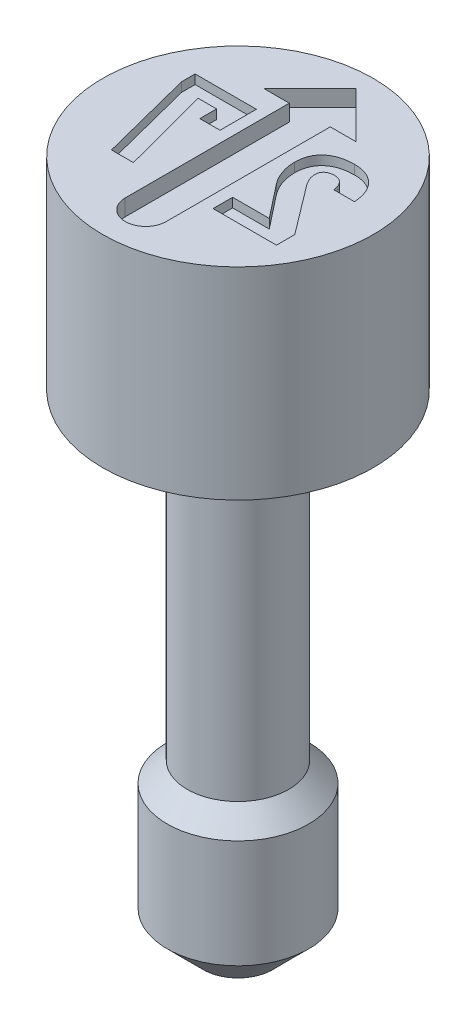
ISO-10303-21;
HEADER;
FILE_DESCRIPTION(('STEP AP214'),'2;1');
FILE_NAME('part.step','',(''),(''),'','','');
FILE_SCHEMA(('AUTOMOTIVE_DESIGN { 1 0 10303 214 1 1 1 1 }'));
ENDSEC;
DATA;
#1=APPLICATION_CONTEXT('core data for automotive mechanical design processes');
#2=APPLICATION_PROTOCOL_DEFINITION('international standard','automotive_design',2000,#1);
#3=PRODUCT_CONTEXT('',#1,'mechanical');
#4=PRODUCT('Part','Part','',(#3));
#5=PRODUCT_RELATED_PRODUCT_CATEGORY('part','',(#4));
#6=PRODUCT_DEFINITION_FORMATION('','',#4);
#7=PRODUCT_DEFINITION_CONTEXT('part definition',#1,'design');
#8=PRODUCT_DEFINITION('design','',#6,#7);
#9=PRODUCT_DEFINITION_SHAPE('','',#8);
#10=(LENGTH_UNIT() NAMED_UNIT(*) SI_UNIT(.MILLI.,.METRE.));
#11=(NAMED_UNIT(*) PLANE_ANGLE_UNIT() SI_UNIT($,.RADIAN.));
#12=(NAMED_UNIT(*) SI_UNIT($,.STERADIAN.) SOLID_ANGLE_UNIT());
#13=UNCERTAINTY_MEASURE_WITH_UNIT(LENGTH_MEASURE(1.E-05),#10,'distance_accuracy_value','');
#14=(GEOMETRIC_REPRESENTATION_CONTEXT(3) GLOBAL_UNCERTAINTY_ASSIGNED_CONTEXT((#13)) GLOBAL_UNIT_ASSIGNED_CONTEXT((#10,
#11,#12)) REPRESENTATION_CONTEXT('',''));
#15=CARTESIAN_POINT('',(0.,0.,0.));
#16=DIRECTION('',(0.,0.,1.));
#17=DIRECTION('',(1.,0.,0.));
#18=AXIS2_PLACEMENT_3D('',#15,#16,#17);
#19=CARTESIAN_POINT('',(0.,17.018,0.));
#20=DIRECTION('',(0.,1.,0.));
#21=DIRECTION('',(0.,0.,1.));
#22=AXIS2_PLACEMENT_3D('',#19,#20,#21);
#23=PLANE('',#22);
#24=DIRECTION('',(1.,0.,0.));
#25=VECTOR('',#24,1.);
#26=CARTESIAN_POINT('',(0.80921684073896,17.018,1.42718515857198));
#27=LINE('',#26,#25);
#28=CARTESIAN_POINT('',(0.80921684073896,17.018,1.42718515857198));
#29=VERTEX_POINT('',#28);
#30=CARTESIAN_POINT('',(2.37975945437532,17.018,1.42718515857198));
#31=VERTEX_POINT('',#30);
#32=EDGE_CURVE('E51',#29,#31,#27,.T.);
#33=ORIENTED_EDGE('',*,*,#32,.F.);
#34=DIRECTION('',(0.,0.,1.));
#35=VECTOR('',#34,1.);
#36=CARTESIAN_POINT('',(0.80921684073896,17.018,0.942276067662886));
#37=LINE('',#36,#35);
#38=CARTESIAN_POINT('',(0.80921684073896,17.018,0.942276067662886));
#39=VERTEX_POINT('',#38);
#40=EDGE_CURVE('E272',#39,#29,#37,.T.);
#41=ORIENTED_EDGE('',*,*,#40,.F.);
#42=DIRECTION('',(-1.,0.,0.));
#43=VECTOR('',#42,1.);
#44=CARTESIAN_POINT('',(1.71679780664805,17.018,0.942276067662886));
#45=LINE('',#44,#43);
#46=CARTESIAN_POINT('',(1.71679780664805,17.018,0.942276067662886));
#47=VERTEX_POINT('',#46);
#48=EDGE_CURVE('E275',#47,#39,#45,.T.);
#49=ORIENTED_EDGE('',*,*,#48,.F.);
#50=DIRECTION('',(0.618183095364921,0.,0.786034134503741));
#51=VECTOR('',#50,1.);
#52=CARTESIAN_POINT('',(1.06303644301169,17.018,0.111003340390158));
#53=LINE('',#52,#51);
#54=CARTESIAN_POINT('',(1.06303644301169,17.018,0.111003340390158));
#55=VERTEX_POINT('',#54);
#56=EDGE_CURVE('E587',#55,#47,#53,.T.);
#57=ORIENTED_EDGE('',*,*,#56,.F.);
#58=CARTESIAN_POINT('',(0.823829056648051,17.018,-0.575229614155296));
#59=CARTESIAN_POINT('',(0.824519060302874,17.018,-0.544884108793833));
#60=CARTESIAN_POINT('',(0.82590028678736,17.018,-0.484139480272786));
#61=CARTESIAN_POINT('',(0.838368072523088,17.018,-0.393226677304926));
#62=CARTESIAN_POINT('',(0.85845966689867,17.018,-0.302778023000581));
#63=CARTESIAN_POINT('',(0.886052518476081,17.018,-0.213230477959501));
#64=CARTESIAN_POINT('',(0.920329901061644,17.018,-0.126135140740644));
#65=CARTESIAN_POINT('',(0.961469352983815,17.018,-0.0426847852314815));
#66=CARTESIAN_POINT('',(1.00790050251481,17.018,0.0371575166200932));
#67=CARTESIAN_POINT('',(1.04469298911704,17.018,0.0864352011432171));
#68=CARTESIAN_POINT('',(1.06303644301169,17.018,0.111003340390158));
#69=B_SPLINE_CURVE_WITH_KNOTS('',3,(#58,#59,#60,#61,#62,#63,#64,#65,#66,#67,#68),.UNSPECIFIED.,
.F.,.F.,(4,1,1,1,1,1,1,1,4),(0.,0.123046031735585,0.246309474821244,0.371480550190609,
0.498560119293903,0.626024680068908,0.750715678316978,0.875715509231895,1.),.UNSPECIFIED.);
#70=CARTESIAN_POINT('',(0.823829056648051,17.018,-0.575229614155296));
#71=VERTEX_POINT('',#70);
#72=EDGE_CURVE('E590',#71,#55,#69,.T.);
#73=ORIENTED_EDGE('',*,*,#72,.F.);
#74=DIRECTION('',(0.,0.,1.));
#75=VECTOR('',#74,1.);
#76=CARTESIAN_POINT('',(0.823829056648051,17.018,-0.577394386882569));
#77=LINE('',#76,#75);
#78=CARTESIAN_POINT('',(0.823829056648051,17.018,-0.577394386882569));
#79=VERTEX_POINT('',#78);
#80=EDGE_CURVE('E595',#79,#71,#77,.T.);
#81=ORIENTED_EDGE('',*,*,#80,.F.);
#82=CARTESIAN_POINT('',(1.60910036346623,17.018,-1.27445120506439));
#83=CARTESIAN_POINT('',(1.5787690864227,17.018,-1.27402034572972));
#84=CARTESIAN_POINT('',(1.51977876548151,17.018,-1.27318238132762));
#85=CARTESIAN_POINT('',(1.43389906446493,17.018,-1.26413681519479));
#86=CARTESIAN_POINT('',(1.3530953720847,17.018,-1.25048441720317));
#87=CARTESIAN_POINT('',(1.27749771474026,17.018,-1.23051161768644));
#88=CARTESIAN_POINT('',(1.2074095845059,17.018,-1.2044588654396));
#89=CARTESIAN_POINT('',(1.14262102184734,17.018,-1.17304566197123));
#90=CARTESIAN_POINT('',(1.08299659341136,17.018,-1.13600431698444));
#91=CARTESIAN_POINT('',(1.02899292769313,17.018,-1.09325565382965));
#92=CARTESIAN_POINT('',(0.980402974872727,17.018,-1.04557633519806));
#93=CARTESIAN_POINT('',(0.938580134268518,17.018,-0.992482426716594));
#94=CARTESIAN_POINT('',(0.902375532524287,17.018,-0.935047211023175));
#95=CARTESIAN_POINT('',(0.874074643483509,17.018,-0.872156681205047));
#96=CARTESIAN_POINT('',(0.850775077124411,17.018,-0.805289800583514));
#97=CARTESIAN_POINT('',(0.835688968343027,17.018,-0.733247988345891));
#98=CARTESIAN_POINT('',(0.825522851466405,17.018,-0.6568794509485));
#99=CARTESIAN_POINT('',(0.824402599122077,17.018,-0.604309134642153));
#100=CARTESIAN_POINT('',(0.823829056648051,17.018,-0.577394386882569));
#101=B_SPLINE_CURVE_WITH_KNOTS('',3,(#82,#83,#84,#85,#86,#87,#88,#89,#90,#91,#92,#93,#94,#95,
#96,#97,#98,#99,#100),.UNSPECIFIED.,.F.,.F.,(4,1,1,1,1,1,1,1,1,1,1,1,1,1,1,1,4),(0.,
0.0762312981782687,0.148259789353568,0.216860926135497,0.28210063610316,0.344528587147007,
0.404571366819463,0.462840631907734,0.520642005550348,0.577409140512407,0.633580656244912,
0.690215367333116,0.747647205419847,0.806597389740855,0.867894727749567,0.932365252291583,1.),.UNSPECIFIED.);
#102=CARTESIAN_POINT('',(1.60910036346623,17.018,-1.27445120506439));
#103=VERTEX_POINT('',#102);
#104=EDGE_CURVE('E601',#103,#79,#101,.T.);
#105=ORIENTED_EDGE('',*,*,#104,.F.);
#106=CARTESIAN_POINT('',(2.41277223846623,17.018,-0.474026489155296));
#107=CARTESIAN_POINT('',(2.41024065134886,17.018,-0.504940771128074));
#108=CARTESIAN_POINT('',(2.40529904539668,17.018,-0.565284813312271));
#109=CARTESIAN_POINT('',(2.38909831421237,17.018,-0.652575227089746));
#110=CARTESIAN_POINT('',(2.36815950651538,17.018,-0.734796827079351));
#111=CARTESIAN_POINT('',(2.3415225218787,17.018,-0.811933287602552));
#112=CARTESIAN_POINT('',(2.30729390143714,17.018,-0.883091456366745));
#113=CARTESIAN_POINT('',(2.26883700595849,17.018,-0.949758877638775));
#114=CARTESIAN_POINT('',(2.22258299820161,17.018,-1.00987355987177));
#115=CARTESIAN_POINT('',(2.1719515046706,17.018,-1.06544705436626));
#116=CARTESIAN_POINT('',(2.11555707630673,17.018,-1.11439538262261));
#117=CARTESIAN_POINT('',(2.0554251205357,17.018,-1.15757437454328));
#118=CARTESIAN_POINT('',(1.99064634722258,17.018,-1.19350629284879));
#119=CARTESIAN_POINT('',(1.92220556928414,17.018,-1.22331394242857));
#120=CARTESIAN_POINT('',(1.84934397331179,17.018,-1.24593710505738));
#121=CARTESIAN_POINT('',(1.77301330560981,17.018,-1.26288357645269));
#122=CARTESIAN_POINT('',(1.69233743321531,17.018,-1.27265665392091));
#123=CARTESIAN_POINT('',(1.63726855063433,17.018,-1.27384391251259));
#124=CARTESIAN_POINT('',(1.60910036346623,17.018,-1.27445120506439));
#125=B_SPLINE_CURVE_WITH_KNOTS('',3,(#106,#107,#108,#109,#110,#111,#112,#113,#114,#115,#116,
#117,#118,#119,#120,#121,#122,#123,#124),.UNSPECIFIED.,.F.,.F.,(4,1,1,1,1,1,1,1,1,1,1,1,1,1,1,1,
4),(0.,0.073326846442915,0.14313249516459,0.209679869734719,0.273918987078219,0.335762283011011,
0.396210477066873,0.45560885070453,0.514796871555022,0.573764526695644,0.631900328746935,
0.689592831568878,0.748648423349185,0.808163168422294,0.86976604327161,0.933384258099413,1.),.UNSPECIFIED.);
#126=CARTESIAN_POINT('',(2.41277223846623,17.018,-0.474026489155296));
#127=VERTEX_POINT('',#126);
#128=EDGE_CURVE('E606',#127,#103,#125,.T.);
#129=ORIENTED_EDGE('',*,*,#128,.F.);
#130=DIRECTION('',(0.,0.,-1.));
#131=VECTOR('',#130,1.);
#132=CARTESIAN_POINT('',(2.41277223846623,17.018,-0.472402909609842));
#133=LINE('',#132,#131);
#134=CARTESIAN_POINT('',(2.41277223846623,17.018,-0.472402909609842));
#135=VERTEX_POINT('',#134);
#136=EDGE_CURVE('E614',#135,#127,#133,.T.);
#137=ORIENTED_EDGE('',*,*,#136,.F.);
#138=DIRECTION('',(1.,0.,0.));
#139=VECTOR('',#138,1.);
#140=CARTESIAN_POINT('',(1.8997211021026,17.018,-0.472402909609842));
#141=LINE('',#140,#139);
#142=CARTESIAN_POINT('',(1.8997211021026,17.018,-0.472402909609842));
#143=VERTEX_POINT('',#142);
#144=EDGE_CURVE('E620',#143,#135,#141,.T.);
#145=ORIENTED_EDGE('',*,*,#144,.F.);
#146=DIRECTION('',(0.,0.,1.));
#147=VECTOR('',#146,1.);
#148=CARTESIAN_POINT('',(1.8997211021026,17.018,-0.474026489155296));
#149=LINE('',#148,#147);
#150=CARTESIAN_POINT('',(1.8997211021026,17.018,-0.474026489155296));
#151=VERTEX_POINT('',#150);
#152=EDGE_CURVE('E623',#151,#143,#149,.T.);
#153=ORIENTED_EDGE('',*,*,#152,.F.);
#154=CARTESIAN_POINT('',(1.60531201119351,17.018,-0.789542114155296));
#155=CARTESIAN_POINT('',(1.62491837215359,17.018,-0.788777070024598));
#156=CARTESIAN_POINT('',(1.66301421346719,17.018,-0.787290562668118));
#157=CARTESIAN_POINT('',(1.71694536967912,17.018,-0.770815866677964));
#158=CARTESIAN_POINT('',(1.76554260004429,17.018,-0.74497410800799));
#159=CARTESIAN_POINT('',(1.80743727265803,17.018,-0.708101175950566));
#160=CARTESIAN_POINT('',(1.84212923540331,17.018,-0.661805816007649));
#161=CARTESIAN_POINT('',(1.87028512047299,17.018,-0.607289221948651));
#162=CARTESIAN_POINT('',(1.88940838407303,17.018,-0.543567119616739));
#163=CARTESIAN_POINT('',(1.89617291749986,17.018,-0.497952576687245));
#164=CARTESIAN_POINT('',(1.8997211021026,17.018,-0.474026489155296));
#165=B_SPLINE_CURVE_WITH_KNOTS('',3,(#154,#155,#156,#157,#158,#159,#160,#161,#162,#163,#164),
.UNSPECIFIED.,.F.,.F.,(4,1,1,1,1,1,1,1,4),(0.,0.122603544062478,0.238222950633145,
0.350089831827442,0.465559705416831,0.58502806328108,0.711014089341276,0.848418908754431,1.),.UNSPECIFIED.);
#166=CARTESIAN_POINT('',(1.60531201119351,17.018,-0.789542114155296));
#167=VERTEX_POINT('',#166);
#168=EDGE_CURVE('E626',#167,#151,#165,.T.);
#169=ORIENTED_EDGE('',*,*,#168,.F.);
#170=CARTESIAN_POINT('',(1.33904496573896,17.018,-0.563323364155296));
#171=CARTESIAN_POINT('',(1.33978426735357,17.018,-0.580375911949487));
#172=CARTESIAN_POINT('',(1.34120065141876,17.018,-0.613045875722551));
#173=CARTESIAN_POINT('',(1.35454521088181,17.018,-0.65907849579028));
#174=CARTESIAN_POINT('',(1.3764162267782,17.018,-0.699165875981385));
#175=CARTESIAN_POINT('',(1.40774080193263,17.018,-0.732277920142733));
#176=CARTESIAN_POINT('',(1.44673750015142,17.018,-0.758467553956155));
#177=CARTESIAN_POINT('',(1.49339813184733,17.018,-0.77692441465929));
#178=CARTESIAN_POINT('',(1.54711218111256,17.018,-0.78750824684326));
#179=CARTESIAN_POINT('',(1.58523822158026,17.018,-0.788840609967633));
#180=CARTESIAN_POINT('',(1.60531201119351,17.018,-0.789542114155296));
#181=B_SPLINE_CURVE_WITH_KNOTS('',3,(#170,#171,#172,#173,#174,#175,#176,#177,#178,#179,#180),
.UNSPECIFIED.,.F.,.F.,(4,1,1,1,1,1,1,1,4),(0.,0.128749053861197,0.246662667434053,
0.359069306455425,0.47107757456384,0.588039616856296,0.711712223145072,0.848213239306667,1.),.UNSPECIFIED.);
#182=CARTESIAN_POINT('',(1.33904496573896,17.018,-0.563323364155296));
#183=VERTEX_POINT('',#182);
#184=EDGE_CURVE('E631',#183,#167,#181,.T.);
#185=ORIENTED_EDGE('',*,*,#184,.F.);
#186=DIRECTION('',(0.,0.,-1.));
#187=VECTOR('',#186,1.);
#188=CARTESIAN_POINT('',(1.33904496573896,17.018,-0.559535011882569));
#189=LINE('',#188,#187);
#190=CARTESIAN_POINT('',(1.33904496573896,17.018,-0.559535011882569));
#191=VERTEX_POINT('',#190);
#192=EDGE_CURVE('E639',#191,#183,#189,.T.);
#193=ORIENTED_EDGE('',*,*,#192,.F.);
#194=CARTESIAN_POINT('',(1.46839013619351,17.018,-0.233736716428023));
#195=CARTESIAN_POINT('',(1.44930134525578,17.018,-0.26063384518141));
#196=CARTESIAN_POINT('',(1.41210741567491,17.018,-0.313042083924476));
#197=CARTESIAN_POINT('',(1.37844404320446,17.018,-0.385014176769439));
#198=CARTESIAN_POINT('',(1.3574731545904,17.018,-0.44144119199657));
#199=CARTESIAN_POINT('',(1.34747889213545,17.018,-0.482361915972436));
#200=CARTESIAN_POINT('',(1.34034929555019,17.018,-0.521404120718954));
#201=CARTESIAN_POINT('',(1.33947176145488,17.018,-0.547058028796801));
#202=CARTESIAN_POINT('',(1.33904496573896,17.018,-0.559535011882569));
#203=B_SPLINE_CURVE_WITH_KNOTS('',3,(#194,#195,#196,#197,#198,#199,#200,#201,#202),
.UNSPECIFIED.,.F.,.F.,(4,1,1,1,1,1,4),(0.,0.277375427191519,0.540457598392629,0.666416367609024,
0.784009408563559,0.894951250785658,1.),.UNSPECIFIED.);
#204=CARTESIAN_POINT('',(1.46839013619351,17.018,-0.233736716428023));
#205=VERTEX_POINT('',#204);
#206=EDGE_CURVE('E645',#205,#191,#203,.T.);
#207=ORIENTED_EDGE('',*,*,#206,.F.);
#208=DIRECTION('',(-0.602458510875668,0.,-0.798150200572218));
#209=VECTOR('',#208,1.);
#210=CARTESIAN_POINT('',(2.37975945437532,17.018,0.97366527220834));
#211=LINE('',#210,#209);
#212=CARTESIAN_POINT('',(2.37975945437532,17.018,0.97366527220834));
#213=VERTEX_POINT('',#212);
#214=EDGE_CURVE('E650',#213,#205,#211,.T.);
#215=ORIENTED_EDGE('',*,*,#214,.F.);
#216=DIRECTION('',(0.,0.,-1.));
#217=VECTOR('',#216,1.);
#218=CARTESIAN_POINT('',(2.37975945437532,17.018,1.42718515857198));
#219=LINE('',#218,#217);
#220=EDGE_CURVE('E656',#31,#213,#219,.T.);
#221=ORIENTED_EDGE('',*,*,#220,.F.);
#222=EDGE_LOOP('',(#33,#41,#49,#57,#73,#81,#105,#129,#137,#145,#153,#169,#185,#193,#207,#215,#221));
#223=FACE_BOUND('',#222,.T.);
#224=DIRECTION('',(-1.,0.,0.));
#225=VECTOR('',#224,1.);
#226=CARTESIAN_POINT('',(-0.784856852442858,17.018,-1.23981484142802));
#227=LINE('',#226,#225);
#228=CARTESIAN_POINT('',(-0.784856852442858,17.018,-1.23981484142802));
#229=VERTEX_POINT('',#228);
#230=CARTESIAN_POINT('',(-2.30236253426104,17.018,-1.23981484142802));
#231=VERTEX_POINT('',#230);
#232=EDGE_CURVE('E59',#229,#231,#227,.T.);
#233=ORIENTED_EDGE('',*,*,#232,.F.);
#234=DIRECTION('',(0.,0.,-1.));
#235=VECTOR('',#234,1.);
#236=CARTESIAN_POINT('',(-0.784856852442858,17.018,-0.339269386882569));
#237=LINE('',#236,#235);
#238=CARTESIAN_POINT('',(-0.784856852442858,17.018,-0.339269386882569));
#239=VERTEX_POINT('',#238);
#240=EDGE_CURVE('E504',#239,#229,#237,.T.);
#241=ORIENTED_EDGE('',*,*,#240,.F.);
#242=DIRECTION('',(1.,0.,0.));
#243=VECTOR('',#242,1.);
#244=CARTESIAN_POINT('',(-1.28546054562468,17.018,-0.339269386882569));
#245=LINE('',#244,#243);
#246=CARTESIAN_POINT('',(-1.28546054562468,17.018,-0.339269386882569));
#247=VERTEX_POINT('',#246);
#248=EDGE_CURVE('E508',#247,#239,#245,.T.);
#249=ORIENTED_EDGE('',*,*,#248,.F.);
#250=DIRECTION('',(0.,0.,1.));
#251=VECTOR('',#250,1.);
#252=CARTESIAN_POINT('',(-1.28546054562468,17.018,-0.754905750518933));
#253=LINE('',#252,#251);
#254=CARTESIAN_POINT('',(-1.28546054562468,17.018,-0.754905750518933));
#255=VERTEX_POINT('',#254);
#256=EDGE_CURVE('E511',#255,#247,#253,.T.);
#257=ORIENTED_EDGE('',*,*,#256,.F.);
#258=DIRECTION('',(1.,0.,0.));
#259=VECTOR('',#258,1.);
#260=CARTESIAN_POINT('',(-1.7416863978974,17.018,-0.754905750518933));
#261=LINE('',#260,#259);
#262=CARTESIAN_POINT('',(-1.7416863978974,17.018,-0.754905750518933));
#263=VERTEX_POINT('',#262);
#264=EDGE_CURVE('E514',#263,#255,#261,.T.);
#265=ORIENTED_EDGE('',*,*,#264,.F.);
#266=DIRECTION('',(-0.255602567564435,0.,-0.966781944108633));
#267=VECTOR('',#266,1.);
#268=CARTESIAN_POINT('',(-1.16477446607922,17.018,1.42718515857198));
#269=LINE('',#268,#267);
#270=CARTESIAN_POINT('',(-1.16477446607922,17.018,1.42718515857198));
#271=VERTEX_POINT('',#270);
#272=EDGE_CURVE('E517',#271,#263,#269,.T.);
#273=ORIENTED_EDGE('',*,*,#272,.F.);
#274=DIRECTION('',(1.,0.,0.));
#275=VECTOR('',#274,1.);
#276=CARTESIAN_POINT('',(-1.70705003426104,17.018,1.42718515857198));
#277=LINE('',#276,#275);
#278=CARTESIAN_POINT('',(-1.70705003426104,17.018,1.42718515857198));
#279=VERTEX_POINT('',#278);
#280=EDGE_CURVE('E520',#279,#271,#277,.T.);
#281=ORIENTED_EDGE('',*,*,#280,.F.);
#282=DIRECTION('',(0.247293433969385,0.,0.968940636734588));
#283=VECTOR('',#282,1.);
#284=CARTESIAN_POINT('',(-2.30236253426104,17.018,-0.905357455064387));
#285=LINE('',#284,#283);
#286=CARTESIAN_POINT('',(-2.30236253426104,17.018,-0.905357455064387));
#287=VERTEX_POINT('',#286);
#288=EDGE_CURVE('E523',#287,#279,#285,.T.);
#289=ORIENTED_EDGE('',*,*,#288,.F.);
#290=DIRECTION('',(0.,0.,1.));
#291=VECTOR('',#290,1.);
#292=CARTESIAN_POINT('',(-2.30236253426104,17.018,-1.23981484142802));
#293=LINE('',#292,#291);
#294=EDGE_CURVE('E526',#231,#287,#293,.T.);
#295=ORIENTED_EDGE('',*,*,#294,.F.);
#296=EDGE_LOOP('',(#233,#241,#249,#257,#265,#273,#281,#289,#295));
#297=FACE_BOUND('',#296,.T.);
#298=CARTESIAN_POINT('',(0.,17.018,2.286));
#299=DIRECTION('',(0.,1.,0.));
#300=DIRECTION('',(0.,0.,1.));
#301=AXIS2_PLACEMENT_3D('',#298,#299,#300);
#302=CIRCLE('',#301,0.508);
#303=CARTESIAN_POINT('',(-0.508,17.018,2.286));
#304=VERTEX_POINT('',#303);
#305=CARTESIAN_POINT('',(0.508,17.018,2.286));
#306=VERTEX_POINT('',#305);
#307=EDGE_CURVE('E463',#304,#306,#302,.T.);
#308=ORIENTED_EDGE('',*,*,#307,.F.);
#309=DIRECTION('',(0.,0.,1.));
#310=VECTOR('',#309,1.);
#311=CARTESIAN_POINT('',(-0.508,17.018,2.286));
#312=LINE('',#311,#310);
#313=CARTESIAN_POINT('',(-0.508,17.018,-1.778));
#314=VERTEX_POINT('',#313);
#315=EDGE_CURVE('E444',#314,#304,#312,.T.);
#316=ORIENTED_EDGE('',*,*,#315,.F.);
#317=DIRECTION('',(1.,0.,0.));
#318=VECTOR('',#317,1.);
#319=CARTESIAN_POINT('',(-0.508,17.018,-1.778));
#320=LINE('',#319,#318);
#321=CARTESIAN_POINT('',(-1.143,17.018,-1.778));
#322=VERTEX_POINT('',#321);
#323=EDGE_CURVE('E448',#322,#314,#320,.T.);
#324=ORIENTED_EDGE('',*,*,#323,.F.);
#325=DIRECTION('',(-0.707106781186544,0.,0.707106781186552));
#326=VECTOR('',#325,1.);
#327=CARTESIAN_POINT('',(0.,17.018,-2.92100000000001));
#328=LINE('',#327,#326);
#329=CARTESIAN_POINT('',(0.,17.018,-2.92100000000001));
#330=VERTEX_POINT('',#329);
#331=EDGE_CURVE('E451',#330,#322,#328,.T.);
#332=ORIENTED_EDGE('',*,*,#331,.F.);
#333=DIRECTION('',(-0.707106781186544,0.,-0.707106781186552));
#334=VECTOR('',#333,1.);
#335=CARTESIAN_POINT('',(1.143,17.018,-1.778));
#336=LINE('',#335,#334);
#337=CARTESIAN_POINT('',(1.143,17.018,-1.778));
#338=VERTEX_POINT('',#337);
#339=EDGE_CURVE('E454',#338,#330,#336,.T.);
#340=ORIENTED_EDGE('',*,*,#339,.F.);
#341=DIRECTION('',(1.,0.,0.));
#342=VECTOR('',#341,1.);
#343=CARTESIAN_POINT('',(0.508,17.018,-1.778));
#344=LINE('',#343,#342);
#345=CARTESIAN_POINT('',(0.508,17.018,-1.778));
#346=VERTEX_POINT('',#345);
#347=EDGE_CURVE('E457',#346,#338,#344,.T.);
#348=ORIENTED_EDGE('',*,*,#347,.F.);
#349=DIRECTION('',(0.,0.,-1.));
#350=VECTOR('',#349,1.);
#351=CARTESIAN_POINT('',(0.508,17.018,2.286));
#352=LINE('',#351,#350);
#353=EDGE_CURVE('E460',#306,#346,#352,.T.);
#354=ORIENTED_EDGE('',*,*,#353,.F.);
#355=EDGE_LOOP('',(#308,#316,#324,#332,#340,#348,#354));
#356=FACE_BOUND('',#355,.T.);
#357=CARTESIAN_POINT('',(0.,17.018,0.));
#358=DIRECTION('',(0.,-1.,0.));
#359=DIRECTION('',(0.,0.,-1.));
#360=AXIS2_PLACEMENT_3D('',#357,#358,#359);
#361=CIRCLE('',#360,3.3528);
#362=CARTESIAN_POINT('',(0.,17.018,-3.3528));
#363=VERTEX_POINT('',#362);
#364=EDGE_CURVE('E11',#363,#363,#361,.T.);
#365=ORIENTED_EDGE('',*,*,#364,.F.);
#366=EDGE_LOOP('',(#365));
#367=FACE_BOUND('',#366,.T.);
#368=ADVANCED_FACE('F37',(#223,#297,#356,#367),#23,.T.);
#369=CARTESIAN_POINT('',(0.,0.,0.));
#370=DIRECTION('',(0.,-1.,0.));
#371=DIRECTION('',(0.,0.,-1.));
#372=AXIS2_PLACEMENT_3D('',#369,#370,#371);
#373=CYLINDRICAL_SURFACE('',#372,3.3528);
#374=ORIENTED_EDGE('',*,*,#364,.T.);
#375=EDGE_LOOP('',(#374));
#376=FACE_BOUND('',#375,.T.);
#377=CARTESIAN_POINT('',(0.,12.0142,0.));
#378=DIRECTION('',(0.,-1.,0.));
#379=DIRECTION('',(0.,0.,-1.));
#380=AXIS2_PLACEMENT_3D('',#377,#378,#379);
#381=CIRCLE('',#380,3.3528);
#382=CARTESIAN_POINT('',(0.,12.0142,-3.3528));
#383=VERTEX_POINT('',#382);
#384=EDGE_CURVE('E44',#383,#383,#381,.T.);
#385=ORIENTED_EDGE('',*,*,#384,.F.);
#386=EDGE_LOOP('',(#385));
#387=FACE_BOUND('',#386,.T.);
#388=ADVANCED_FACE('F400',(#376,#387),#373,.T.);
#389=CARTESIAN_POINT('',(3.3528,12.0142,0.));
#390=DIRECTION('',(0.,-1.,0.));
#391=DIRECTION('',(0.,0.,-1.));
#392=AXIS2_PLACEMENT_3D('',#389,#390,#391);
#393=PLANE('',#392);
#394=ORIENTED_EDGE('',*,*,#384,.T.);
#395=EDGE_LOOP('',(#394));
#396=FACE_BOUND('',#395,.T.);
#397=CARTESIAN_POINT('',(0.,12.0142,0.));
#398=DIRECTION('',(0.,-1.,0.));
#399=DIRECTION('',(0.,0.,-1.));
#400=AXIS2_PLACEMENT_3D('',#397,#398,#399);
#401=CIRCLE('',#400,1.2573);
#402=CARTESIAN_POINT('',(0.,12.0142,-1.2573));
#403=VERTEX_POINT('',#402);
#404=EDGE_CURVE('E412',#403,#403,#401,.T.);
#405=ORIENTED_EDGE('',*,*,#404,.F.);
#406=EDGE_LOOP('',(#405));
#407=FACE_BOUND('',#406,.T.);
#408=ADVANCED_FACE('F397',(#396,#407),#393,.T.);
#409=CARTESIAN_POINT('',(0.,0.,0.));
#410=DIRECTION('',(0.,-1.,0.));
#411=DIRECTION('',(0.,0.,-1.));
#412=AXIS2_PLACEMENT_3D('',#409,#410,#411);
#413=CYLINDRICAL_SURFACE('',#412,1.2573);
#414=ORIENTED_EDGE('',*,*,#404,.T.);
#415=EDGE_LOOP('',(#414));
#416=FACE_BOUND('',#415,.T.);
#417=CARTESIAN_POINT('',(0.,4.064,0.));
#418=DIRECTION('',(0.,-1.,0.));
#419=DIRECTION('',(0.,0.,-1.));
#420=AXIS2_PLACEMENT_3D('',#417,#418,#419);
#421=CIRCLE('',#420,1.2573);
#422=CARTESIAN_POINT('',(0.,4.064,-1.2573));
#423=VERTEX_POINT('',#422);
#424=EDGE_CURVE('E414',#423,#423,#421,.T.);
#425=ORIENTED_EDGE('',*,*,#424,.F.);
#426=EDGE_LOOP('',(#425));
#427=FACE_BOUND('',#426,.T.);
#428=ADVANCED_FACE('F393',(#416,#427),#413,.T.);
#429=CARTESIAN_POINT('',(0.,3.56870000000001,0.));
#430=DIRECTION('',(0.,-1.,0.));
#431=DIRECTION('',(0.,0.,-1.));
#432=AXIS2_PLACEMENT_3D('',#429,#430,#431);
#433=CONICAL_SURFACE('',#432,1.7526,0.785398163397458);
#434=ORIENTED_EDGE('',*,*,#424,.T.);
#435=EDGE_LOOP('',(#434));
#436=FACE_BOUND('',#435,.T.);
#437=CARTESIAN_POINT('',(0.,3.56870000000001,0.));
#438=DIRECTION('',(0.,-1.,0.));
#439=DIRECTION('',(0.,0.,-1.));
#440=AXIS2_PLACEMENT_3D('',#437,#438,#439);
#441=CIRCLE('',#440,1.7526);
#442=CARTESIAN_POINT('',(0.,3.56870000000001,-1.7526));
#443=VERTEX_POINT('',#442);
#444=EDGE_CURVE('E419',#443,#443,#441,.T.);
#445=ORIENTED_EDGE('',*,*,#444,.F.);
#446=EDGE_LOOP('',(#445));
#447=FACE_BOUND('',#446,.T.);
#448=ADVANCED_FACE('F389',(#436,#447),#433,.T.);
#449=CARTESIAN_POINT('',(0.,0.,0.));
#450=DIRECTION('',(0.,-1.,0.));
#451=DIRECTION('',(0.,0.,-1.));
#452=AXIS2_PLACEMENT_3D('',#449,#450,#451);
#453=CYLINDRICAL_SURFACE('',#452,1.7526);
#454=ORIENTED_EDGE('',*,*,#444,.T.);
#455=EDGE_LOOP('',(#454));
#456=FACE_BOUND('',#455,.T.);
#457=CARTESIAN_POINT('',(0.,0.889,0.));
#458=DIRECTION('',(0.,-1.,0.));
#459=DIRECTION('',(0.,0.,-1.));
#460=AXIS2_PLACEMENT_3D('',#457,#458,#459);
#461=CIRCLE('',#460,1.7526);
#462=CARTESIAN_POINT('',(0.,0.889,-1.7526));
#463=VERTEX_POINT('',#462);
#464=EDGE_CURVE('E422',#463,#463,#461,.T.);
#465=ORIENTED_EDGE('',*,*,#464,.F.);
#466=EDGE_LOOP('',(#465));
#467=FACE_BOUND('',#466,.T.);
#468=ADVANCED_FACE('F385',(#456,#467),#453,.T.);
#469=CARTESIAN_POINT('',(0.,0.,0.));
#470=DIRECTION('',(0.,1.,0.));
#471=DIRECTION('',(0.,0.,1.));
#472=AXIS2_PLACEMENT_3D('',#469,#470,#471);
#473=CONICAL_SURFACE('',#472,0.863600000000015,0.78539816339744);
#474=ORIENTED_EDGE('',*,*,#464,.T.);
#475=EDGE_LOOP('',(#474));
#476=FACE_BOUND('',#475,.T.);
#477=CARTESIAN_POINT('',(0.,0.,0.));
#478=DIRECTION('',(0.,-1.,0.));
#479=DIRECTION('',(0.,0.,-1.));
#480=AXIS2_PLACEMENT_3D('',#477,#478,#479);
#481=CIRCLE('',#480,0.863600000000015);
#482=CARTESIAN_POINT('',(0.,0.,-0.863600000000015));
#483=VERTEX_POINT('',#482);
#484=EDGE_CURVE('E425',#483,#483,#481,.T.);
#485=ORIENTED_EDGE('',*,*,#484,.F.);
#486=EDGE_LOOP('',(#485));
#487=FACE_BOUND('',#486,.T.);
#488=ADVANCED_FACE('F381',(#476,#487),#473,.T.);
#489=CARTESIAN_POINT('',(0.863600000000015,0.,0.));
#490=DIRECTION('',(0.,-1.,0.));
#491=DIRECTION('',(0.,0.,-1.));
#492=AXIS2_PLACEMENT_3D('',#489,#490,#491);
#493=PLANE('',#492);
#494=ORIENTED_EDGE('',*,*,#484,.T.);
#495=EDGE_LOOP('',(#494));
#496=FACE_BOUND('',#495,.T.);
#497=ADVANCED_FACE('F377',(#496),#493,.T.);
#498=CARTESIAN_POINT('',(0.,16.6116,2.286));
#499=DIRECTION('',(0.,1.,0.));
#500=DIRECTION('',(0.,0.,1.));
#501=AXIS2_PLACEMENT_3D('',#498,#499,#500);
#502=CYLINDRICAL_SURFACE('',#501,0.508);
#503=ORIENTED_EDGE('',*,*,#307,.T.);
#504=DIRECTION('',(0.,1.,0.));
#505=VECTOR('',#504,1.);
#506=CARTESIAN_POINT('',(0.508,16.6116,2.286));
#507=LINE('',#506,#505);
#508=CARTESIAN_POINT('',(0.508,16.6116,2.286));
#509=VERTEX_POINT('',#508);
#510=EDGE_CURVE('E429',#509,#306,#507,.T.);
#511=ORIENTED_EDGE('',*,*,#510,.F.);
#512=CARTESIAN_POINT('',(0.,16.6116,2.286));
#513=DIRECTION('',(0.,1.,0.));
#514=DIRECTION('',(0.,0.,1.));
#515=AXIS2_PLACEMENT_3D('',#512,#513,#514);
#516=CIRCLE('',#515,0.508);
#517=CARTESIAN_POINT('',(-0.508,16.6116,2.286));
#518=VERTEX_POINT('',#517);
#519=EDGE_CURVE('E447',#518,#509,#516,.T.);
#520=ORIENTED_EDGE('',*,*,#519,.F.);
#521=DIRECTION('',(0.,1.,0.));
#522=VECTOR('',#521,1.);
#523=CARTESIAN_POINT('',(-0.508,16.6116,2.286));
#524=LINE('',#523,#522);
#525=EDGE_CURVE('E428',#518,#304,#524,.T.);
#526=ORIENTED_EDGE('',*,*,#525,.T.);
#527=EDGE_LOOP('',(#503,#511,#520,#526));
#528=FACE_BOUND('',#527,.T.);
#529=ADVANCED_FACE('F355',(#528),#502,.F.);
#530=CARTESIAN_POINT('',(-0.508,16.6116,2.286));
#531=DIRECTION('',(-1.,0.,0.));
#532=DIRECTION('',(0.,0.,1.));
#533=AXIS2_PLACEMENT_3D('',#530,#531,#532);
#534=PLANE('',#533);
#535=ORIENTED_EDGE('',*,*,#315,.T.);
#536=ORIENTED_EDGE('',*,*,#525,.F.);
#537=DIRECTION('',(0.,0.,1.));
#538=VECTOR('',#537,1.);
#539=CARTESIAN_POINT('',(-0.508,16.6116,2.286));
#540=LINE('',#539,#538);
#541=CARTESIAN_POINT('',(-0.508,16.6116,-1.778));
#542=VERTEX_POINT('',#541);
#543=EDGE_CURVE('E433',#542,#518,#540,.T.);
#544=ORIENTED_EDGE('',*,*,#543,.F.);
#545=DIRECTION('',(0.,1.,0.));
#546=VECTOR('',#545,1.);
#547=CARTESIAN_POINT('',(-0.508,16.6116,-1.778));
#548=LINE('',#547,#546);
#549=EDGE_CURVE('E441',#542,#314,#548,.T.);
#550=ORIENTED_EDGE('',*,*,#549,.T.);
#551=EDGE_LOOP('',(#535,#536,#544,#550));
#552=FACE_BOUND('',#551,.T.);
#553=ADVANCED_FACE('F351',(#552),#534,.F.);
#554=CARTESIAN_POINT('',(-0.508,16.6116,-1.778));
#555=DIRECTION('',(0.,0.,1.));
#556=DIRECTION('',(1.,0.,0.));
#557=AXIS2_PLACEMENT_3D('',#554,#555,#556);
#558=PLANE('',#557);
#559=ORIENTED_EDGE('',*,*,#323,.T.);
#560=ORIENTED_EDGE('',*,*,#549,.F.);
#561=DIRECTION('',(1.,0.,0.));
#562=VECTOR('',#561,1.);
#563=CARTESIAN_POINT('',(-0.508,16.6116,-1.778));
#564=LINE('',#563,#562);
#565=CARTESIAN_POINT('',(-1.143,16.6116,-1.778));
#566=VERTEX_POINT('',#565);
#567=EDGE_CURVE('E468',#566,#542,#564,.T.);
#568=ORIENTED_EDGE('',*,*,#567,.F.);
#569=DIRECTION('',(0.,1.,0.));
#570=VECTOR('',#569,1.);
#571=CARTESIAN_POINT('',(-1.143,16.6116,-1.778));
#572=LINE('',#571,#570);
#573=EDGE_CURVE('E439',#566,#322,#572,.T.);
#574=ORIENTED_EDGE('',*,*,#573,.T.);
#575=EDGE_LOOP('',(#559,#560,#568,#574));
#576=FACE_BOUND('',#575,.T.);
#577=ADVANCED_FACE('F354',(#576),#558,.F.);
#578=CARTESIAN_POINT('',(0.,16.6116,-2.92100000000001));
#579=DIRECTION('',(-0.707106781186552,0.,-0.707106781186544));
#580=DIRECTION('',(-0.707106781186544,0.,0.707106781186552));
#581=AXIS2_PLACEMENT_3D('',#578,#579,#580);
#582=PLANE('',#581);
#583=ORIENTED_EDGE('',*,*,#331,.T.);
#584=ORIENTED_EDGE('',*,*,#573,.F.);
#585=DIRECTION('',(-0.707106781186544,0.,0.707106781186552));
#586=VECTOR('',#585,1.);
#587=CARTESIAN_POINT('',(0.,16.6116,-2.92100000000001));
#588=LINE('',#587,#586);
#589=CARTESIAN_POINT('',(0.,16.6116,-2.92100000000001));
#590=VERTEX_POINT('',#589);
#591=EDGE_CURVE('E471',#590,#566,#588,.T.);
#592=ORIENTED_EDGE('',*,*,#591,.F.);
#593=DIRECTION('',(0.,1.,0.));
#594=VECTOR('',#593,1.);
#595=CARTESIAN_POINT('',(0.,16.6116,-2.92100000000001));
#596=LINE('',#595,#594);
#597=EDGE_CURVE('E437',#590,#330,#596,.T.);
#598=ORIENTED_EDGE('',*,*,#597,.T.);
#599=EDGE_LOOP('',(#583,#584,#592,#598));
#600=FACE_BOUND('',#599,.T.);
#601=ADVANCED_FACE('F359',(#600),#582,.F.);
#602=CARTESIAN_POINT('',(1.143,16.6116,-1.778));
#603=DIRECTION('',(0.707106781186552,0.,-0.707106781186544));
#604=DIRECTION('',(-0.707106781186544,0.,-0.707106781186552));
#605=AXIS2_PLACEMENT_3D('',#602,#603,#604);
#606=PLANE('',#605);
#607=ORIENTED_EDGE('',*,*,#339,.T.);
#608=ORIENTED_EDGE('',*,*,#597,.F.);
#609=DIRECTION('',(-0.707106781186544,0.,-0.707106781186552));
#610=VECTOR('',#609,1.);
#611=CARTESIAN_POINT('',(1.143,16.6116,-1.778));
#612=LINE('',#611,#610);
#613=CARTESIAN_POINT('',(1.143,16.6116,-1.778));
#614=VERTEX_POINT('',#613);
#615=EDGE_CURVE('E474',#614,#590,#612,.T.);
#616=ORIENTED_EDGE('',*,*,#615,.F.);
#617=DIRECTION('',(0.,1.,0.));
#618=VECTOR('',#617,1.);
#619=CARTESIAN_POINT('',(1.143,16.6116,-1.778));
#620=LINE('',#619,#618);
#621=EDGE_CURVE('E435',#614,#338,#620,.T.);
#622=ORIENTED_EDGE('',*,*,#621,.T.);
#623=EDGE_LOOP('',(#607,#608,#616,#622));
#624=FACE_BOUND('',#623,.T.);
#625=ADVANCED_FACE('F363',(#624),#606,.F.);
#626=CARTESIAN_POINT('',(0.508,16.6116,-1.778));
#627=DIRECTION('',(0.,0.,1.));
#628=DIRECTION('',(1.,0.,0.));
#629=AXIS2_PLACEMENT_3D('',#626,#627,#628);
#630=PLANE('',#629);
#631=ORIENTED_EDGE('',*,*,#347,.T.);
#632=ORIENTED_EDGE('',*,*,#621,.F.);
#633=DIRECTION('',(1.,0.,0.));
#634=VECTOR('',#633,1.);
#635=CARTESIAN_POINT('',(0.508,16.6116,-1.778));
#636=LINE('',#635,#634);
#637=CARTESIAN_POINT('',(0.508,16.6116,-1.778));
#638=VERTEX_POINT('',#637);
#639=EDGE_CURVE('E477',#638,#614,#636,.T.);
#640=ORIENTED_EDGE('',*,*,#639,.F.);
#641=DIRECTION('',(0.,1.,0.));
#642=VECTOR('',#641,1.);
#643=CARTESIAN_POINT('',(0.508,16.6116,-1.778));
#644=LINE('',#643,#642);
#645=EDGE_CURVE('E432',#638,#346,#644,.T.);
#646=ORIENTED_EDGE('',*,*,#645,.T.);
#647=EDGE_LOOP('',(#631,#632,#640,#646));
#648=FACE_BOUND('',#647,.T.);
#649=ADVANCED_FACE('F367',(#648),#630,.F.);
#650=CARTESIAN_POINT('',(0.508,16.6116,2.286));
#651=DIRECTION('',(1.,0.,0.));
#652=DIRECTION('',(0.,0.,-1.));
#653=AXIS2_PLACEMENT_3D('',#650,#651,#652);
#654=PLANE('',#653);
#655=ORIENTED_EDGE('',*,*,#353,.T.);
#656=ORIENTED_EDGE('',*,*,#645,.F.);
#657=DIRECTION('',(0.,0.,-1.));
#658=VECTOR('',#657,1.);
#659=CARTESIAN_POINT('',(0.508,16.6116,2.286));
#660=LINE('',#659,#658);
#661=EDGE_CURVE('E480',#509,#638,#660,.T.);
#662=ORIENTED_EDGE('',*,*,#661,.F.);
#663=ORIENTED_EDGE('',*,*,#510,.T.);
#664=EDGE_LOOP('',(#655,#656,#662,#663));
#665=FACE_BOUND('',#664,.T.);
#666=ADVANCED_FACE('F349',(#665),#654,.F.);
#667=CARTESIAN_POINT('',(0.,16.6116,2.286));
#668=DIRECTION('',(0.,1.,0.));
#669=DIRECTION('',(0.,0.,1.));
#670=AXIS2_PLACEMENT_3D('',#667,#668,#669);
#671=PLANE('',#670);
#672=ORIENTED_EDGE('',*,*,#519,.T.);
#673=ORIENTED_EDGE('',*,*,#661,.T.);
#674=ORIENTED_EDGE('',*,*,#639,.T.);
#675=ORIENTED_EDGE('',*,*,#615,.T.);
#676=ORIENTED_EDGE('',*,*,#591,.T.);
#677=ORIENTED_EDGE('',*,*,#567,.T.);
#678=ORIENTED_EDGE('',*,*,#543,.T.);
#679=EDGE_LOOP('',(#672,#673,#674,#675,#676,#677,#678));
#680=FACE_BOUND('',#679,.T.);
#681=ADVANCED_FACE('F346',(#680),#671,.T.);
#682=CARTESIAN_POINT('',(-0.784856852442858,16.7894,-1.23981484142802));
#683=DIRECTION('',(0.,0.,-1.));
#684=DIRECTION('',(-1.,0.,0.));
#685=AXIS2_PLACEMENT_3D('',#682,#683,#684);
#686=PLANE('',#685);
#687=ORIENTED_EDGE('',*,*,#232,.T.);
#688=DIRECTION('',(0.,1.,0.));
#689=VECTOR('',#688,1.);
#690=CARTESIAN_POINT('',(-2.30236253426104,16.7894,-1.23981484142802));
#691=LINE('',#690,#689);
#692=CARTESIAN_POINT('',(-2.30236253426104,16.7894,-1.23981484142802));
#693=VERTEX_POINT('',#692);
#694=EDGE_CURVE('E485',#693,#231,#691,.T.);
#695=ORIENTED_EDGE('',*,*,#694,.F.);
#696=DIRECTION('',(-1.,0.,0.));
#697=VECTOR('',#696,1.);
#698=CARTESIAN_POINT('',(-0.784856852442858,16.7894,-1.23981484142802));
#699=LINE('',#698,#697);
#700=CARTESIAN_POINT('',(-0.784856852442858,16.7894,-1.23981484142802));
#701=VERTEX_POINT('',#700);
#702=EDGE_CURVE('E507',#701,#693,#699,.T.);
#703=ORIENTED_EDGE('',*,*,#702,.F.);
#704=DIRECTION('',(0.,1.,0.));
#705=VECTOR('',#704,1.);
#706=CARTESIAN_POINT('',(-0.784856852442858,16.7894,-1.23981484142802));
#707=LINE('',#706,#705);
#708=EDGE_CURVE('E502',#701,#229,#707,.T.);
#709=ORIENTED_EDGE('',*,*,#708,.T.);
#710=EDGE_LOOP('',(#687,#695,#703,#709));
#711=FACE_BOUND('',#710,.T.);
#712=ADVANCED_FACE('F316',(#711),#686,.F.);
#713=CARTESIAN_POINT('',(-0.784856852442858,16.7894,-0.339269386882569));
#714=DIRECTION('',(1.,0.,0.));
#715=DIRECTION('',(0.,0.,-1.));
#716=AXIS2_PLACEMENT_3D('',#713,#714,#715);
#717=PLANE('',#716);
#718=ORIENTED_EDGE('',*,*,#240,.T.);
#719=ORIENTED_EDGE('',*,*,#708,.F.);
#720=DIRECTION('',(0.,0.,-1.));
#721=VECTOR('',#720,1.);
#722=CARTESIAN_POINT('',(-0.784856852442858,16.7894,-0.339269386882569));
#723=LINE('',#722,#721);
#724=CARTESIAN_POINT('',(-0.784856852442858,16.7894,-0.339269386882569));
#725=VERTEX_POINT('',#724);
#726=EDGE_CURVE('E488',#725,#701,#723,.T.);
#727=ORIENTED_EDGE('',*,*,#726,.F.);
#728=DIRECTION('',(0.,1.,0.));
#729=VECTOR('',#728,1.);
#730=CARTESIAN_POINT('',(-0.784856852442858,16.7894,-0.339269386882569));
#731=LINE('',#730,#729);
#732=EDGE_CURVE('E500',#725,#239,#731,.T.);
#733=ORIENTED_EDGE('',*,*,#732,.T.);
#734=EDGE_LOOP('',(#718,#719,#727,#733));
#735=FACE_BOUND('',#734,.T.);
#736=ADVANCED_FACE('F312',(#735),#717,.F.);
#737=CARTESIAN_POINT('',(-1.28546054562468,16.7894,-0.339269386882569));
#738=DIRECTION('',(0.,0.,1.));
#739=DIRECTION('',(1.,0.,0.));
#740=AXIS2_PLACEMENT_3D('',#737,#738,#739);
#741=PLANE('',#740);
#742=ORIENTED_EDGE('',*,*,#248,.T.);
#743=ORIENTED_EDGE('',*,*,#732,.F.);
#744=DIRECTION('',(1.,0.,0.));
#745=VECTOR('',#744,1.);
#746=CARTESIAN_POINT('',(-1.28546054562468,16.7894,-0.339269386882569));
#747=LINE('',#746,#745);
#748=CARTESIAN_POINT('',(-1.28546054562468,16.7894,-0.339269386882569));
#749=VERTEX_POINT('',#748);
#750=EDGE_CURVE('E532',#749,#725,#747,.T.);
#751=ORIENTED_EDGE('',*,*,#750,.F.);
#752=DIRECTION('',(0.,1.,0.));
#753=VECTOR('',#752,1.);
#754=CARTESIAN_POINT('',(-1.28546054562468,16.7894,-0.339269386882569));
#755=LINE('',#754,#753);
#756=EDGE_CURVE('E498',#749,#247,#755,.T.);
#757=ORIENTED_EDGE('',*,*,#756,.T.);
#758=EDGE_LOOP('',(#742,#743,#751,#757));
#759=FACE_BOUND('',#758,.T.);
#760=ADVANCED_FACE('F315',(#759),#741,.F.);
#761=CARTESIAN_POINT('',(-1.28546054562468,16.7894,-0.754905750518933));
#762=DIRECTION('',(-1.,0.,0.));
#763=DIRECTION('',(0.,0.,1.));
#764=AXIS2_PLACEMENT_3D('',#761,#762,#763);
#765=PLANE('',#764);
#766=ORIENTED_EDGE('',*,*,#256,.T.);
#767=ORIENTED_EDGE('',*,*,#756,.F.);
#768=DIRECTION('',(0.,0.,1.));
#769=VECTOR('',#768,1.);
#770=CARTESIAN_POINT('',(-1.28546054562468,16.7894,-0.754905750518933));
#771=LINE('',#770,#769);
#772=CARTESIAN_POINT('',(-1.28546054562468,16.7894,-0.754905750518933));
#773=VERTEX_POINT('',#772);
#774=EDGE_CURVE('E535',#773,#749,#771,.T.);
#775=ORIENTED_EDGE('',*,*,#774,.F.);
#776=DIRECTION('',(0.,1.,0.));
#777=VECTOR('',#776,1.);
#778=CARTESIAN_POINT('',(-1.28546054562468,16.7894,-0.754905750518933));
#779=LINE('',#778,#777);
#780=EDGE_CURVE('E496',#773,#255,#779,.T.);
#781=ORIENTED_EDGE('',*,*,#780,.T.);
#782=EDGE_LOOP('',(#766,#767,#775,#781));
#783=FACE_BOUND('',#782,.T.);
#784=ADVANCED_FACE('F320',(#783),#765,.F.);
#785=CARTESIAN_POINT('',(-1.7416863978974,16.7894,-0.754905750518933));
#786=DIRECTION('',(0.,0.,1.));
#787=DIRECTION('',(1.,0.,0.));
#788=AXIS2_PLACEMENT_3D('',#785,#786,#787);
#789=PLANE('',#788);
#790=ORIENTED_EDGE('',*,*,#264,.T.);
#791=ORIENTED_EDGE('',*,*,#780,.F.);
#792=DIRECTION('',(1.,0.,0.));
#793=VECTOR('',#792,1.);
#794=CARTESIAN_POINT('',(-1.7416863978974,16.7894,-0.754905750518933));
#795=LINE('',#794,#793);
#796=CARTESIAN_POINT('',(-1.7416863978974,16.7894,-0.754905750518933));
#797=VERTEX_POINT('',#796);
#798=EDGE_CURVE('E538',#797,#773,#795,.T.);
#799=ORIENTED_EDGE('',*,*,#798,.F.);
#800=DIRECTION('',(0.,1.,0.));
#801=VECTOR('',#800,1.);
#802=CARTESIAN_POINT('',(-1.7416863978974,16.7894,-0.754905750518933));
#803=LINE('',#802,#801);
#804=EDGE_CURVE('E494',#797,#263,#803,.T.);
#805=ORIENTED_EDGE('',*,*,#804,.T.);
#806=EDGE_LOOP('',(#790,#791,#799,#805));
#807=FACE_BOUND('',#806,.T.);
#808=ADVANCED_FACE('F324',(#807),#789,.F.);
#809=CARTESIAN_POINT('',(-1.16477446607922,16.7894,1.42718515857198));
#810=DIRECTION('',(0.966781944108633,0.,-0.255602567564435));
#811=DIRECTION('',(-0.255602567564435,0.,-0.966781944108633));
#812=AXIS2_PLACEMENT_3D('',#809,#810,#811);
#813=PLANE('',#812);
#814=ORIENTED_EDGE('',*,*,#272,.T.);
#815=ORIENTED_EDGE('',*,*,#804,.F.);
#816=DIRECTION('',(-0.255602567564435,0.,-0.966781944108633));
#817=VECTOR('',#816,1.);
#818=CARTESIAN_POINT('',(-1.16477446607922,16.7894,1.42718515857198));
#819=LINE('',#818,#817);
#820=CARTESIAN_POINT('',(-1.16477446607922,16.7894,1.42718515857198));
#821=VERTEX_POINT('',#820);
#822=EDGE_CURVE('E541',#821,#797,#819,.T.);
#823=ORIENTED_EDGE('',*,*,#822,.F.);
#824=DIRECTION('',(0.,1.,0.));
#825=VECTOR('',#824,1.);
#826=CARTESIAN_POINT('',(-1.16477446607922,16.7894,1.42718515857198));
#827=LINE('',#826,#825);
#828=EDGE_CURVE('E492',#821,#271,#827,.T.);
#829=ORIENTED_EDGE('',*,*,#828,.T.);
#830=EDGE_LOOP('',(#814,#815,#823,#829));
#831=FACE_BOUND('',#830,.T.);
#832=ADVANCED_FACE('F328',(#831),#813,.F.);
#833=CARTESIAN_POINT('',(-1.70705003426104,16.7894,1.42718515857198));
#834=DIRECTION('',(0.,0.,1.));
#835=DIRECTION('',(1.,0.,0.));
#836=AXIS2_PLACEMENT_3D('',#833,#834,#835);
#837=PLANE('',#836);
#838=ORIENTED_EDGE('',*,*,#280,.T.);
#839=ORIENTED_EDGE('',*,*,#828,.F.);
#840=DIRECTION('',(1.,0.,0.));
#841=VECTOR('',#840,1.);
#842=CARTESIAN_POINT('',(-1.70705003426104,16.7894,1.42718515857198));
#843=LINE('',#842,#841);
#844=CARTESIAN_POINT('',(-1.70705003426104,16.7894,1.42718515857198));
#845=VERTEX_POINT('',#844);
#846=EDGE_CURVE('E544',#845,#821,#843,.T.);
#847=ORIENTED_EDGE('',*,*,#846,.F.);
#848=DIRECTION('',(0.,1.,0.));
#849=VECTOR('',#848,1.);
#850=CARTESIAN_POINT('',(-1.70705003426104,16.7894,1.42718515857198));
#851=LINE('',#850,#849);
#852=EDGE_CURVE('E490',#845,#279,#851,.T.);
#853=ORIENTED_EDGE('',*,*,#852,.T.);
#854=EDGE_LOOP('',(#838,#839,#847,#853));
#855=FACE_BOUND('',#854,.T.);
#856=ADVANCED_FACE('F332',(#855),#837,.F.);
#857=CARTESIAN_POINT('',(-2.30236253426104,16.7894,-0.905357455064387));
#858=DIRECTION('',(-0.968940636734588,0.,0.247293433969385));
#859=DIRECTION('',(0.247293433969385,0.,0.968940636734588));
#860=AXIS2_PLACEMENT_3D('',#857,#858,#859);
#861=PLANE('',#860);
#862=ORIENTED_EDGE('',*,*,#288,.T.);
#863=ORIENTED_EDGE('',*,*,#852,.F.);
#864=DIRECTION('',(0.247293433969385,0.,0.968940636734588));
#865=VECTOR('',#864,1.);
#866=CARTESIAN_POINT('',(-2.30236253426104,16.7894,-0.905357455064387));
#867=LINE('',#866,#865);
#868=CARTESIAN_POINT('',(-2.30236253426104,16.7894,-0.905357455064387));
#869=VERTEX_POINT('',#868);
#870=EDGE_CURVE('E547',#869,#845,#867,.T.);
#871=ORIENTED_EDGE('',*,*,#870,.F.);
#872=DIRECTION('',(0.,1.,0.));
#873=VECTOR('',#872,1.);
#874=CARTESIAN_POINT('',(-2.30236253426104,16.7894,-0.905357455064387));
#875=LINE('',#874,#873);
#876=EDGE_CURVE('E487',#869,#287,#875,.T.);
#877=ORIENTED_EDGE('',*,*,#876,.T.);
#878=EDGE_LOOP('',(#862,#863,#871,#877));
#879=FACE_BOUND('',#878,.T.);
#880=ADVANCED_FACE('F336',(#879),#861,.F.);
#881=CARTESIAN_POINT('',(-2.30236253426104,16.7894,-1.23981484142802));
#882=DIRECTION('',(-1.,0.,0.));
#883=DIRECTION('',(0.,0.,1.));
#884=AXIS2_PLACEMENT_3D('',#881,#882,#883);
#885=PLANE('',#884);
#886=ORIENTED_EDGE('',*,*,#294,.T.);
#887=ORIENTED_EDGE('',*,*,#876,.F.);
#888=DIRECTION('',(0.,0.,1.));
#889=VECTOR('',#888,1.);
#890=CARTESIAN_POINT('',(-2.30236253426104,16.7894,-1.23981484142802));
#891=LINE('',#890,#889);
#892=EDGE_CURVE('E550',#693,#869,#891,.T.);
#893=ORIENTED_EDGE('',*,*,#892,.F.);
#894=ORIENTED_EDGE('',*,*,#694,.T.);
#895=EDGE_LOOP('',(#886,#887,#893,#894));
#896=FACE_BOUND('',#895,.T.);
#897=ADVANCED_FACE('F310',(#896),#885,.F.);
#898=CARTESIAN_POINT('',(0.,16.7894,0.));
#899=DIRECTION('',(0.,1.,0.));
#900=DIRECTION('',(0.,0.,1.));
#901=AXIS2_PLACEMENT_3D('',#898,#899,#900);
#902=PLANE('',#901);
#903=ORIENTED_EDGE('',*,*,#702,.T.);
#904=ORIENTED_EDGE('',*,*,#892,.T.);
#905=ORIENTED_EDGE('',*,*,#870,.T.);
#906=ORIENTED_EDGE('',*,*,#846,.T.);
#907=ORIENTED_EDGE('',*,*,#822,.T.);
#908=ORIENTED_EDGE('',*,*,#798,.T.);
#909=ORIENTED_EDGE('',*,*,#774,.T.);
#910=ORIENTED_EDGE('',*,*,#750,.T.);
#911=ORIENTED_EDGE('',*,*,#726,.T.);
#912=EDGE_LOOP('',(#903,#904,#905,#906,#907,#908,#909,#910,#911));
#913=FACE_BOUND('',#912,.T.);
#914=ADVANCED_FACE('F307',(#913),#902,.T.);
#915=CARTESIAN_POINT('',(0.80921684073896,16.7894,1.42718515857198));
#916=DIRECTION('',(0.,0.,1.));
#917=DIRECTION('',(1.,0.,0.));
#918=AXIS2_PLACEMENT_3D('',#915,#916,#917);
#919=PLANE('',#918);
#920=ORIENTED_EDGE('',*,*,#32,.T.);
#921=DIRECTION('',(0.,1.,0.));
#922=VECTOR('',#921,1.);
#923=CARTESIAN_POINT('',(2.37975945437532,16.7894,1.42718515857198));
#924=LINE('',#923,#922);
#925=CARTESIAN_POINT('',(2.37975945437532,16.7894,1.42718515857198));
#926=VERTEX_POINT('',#925);
#927=EDGE_CURVE('E249',#926,#31,#924,.T.);
#928=ORIENTED_EDGE('',*,*,#927,.F.);
#929=DIRECTION('',(1.,0.,0.));
#930=VECTOR('',#929,1.);
#931=CARTESIAN_POINT('',(0.80921684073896,16.7894,1.42718515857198));
#932=LINE('',#931,#930);
#933=CARTESIAN_POINT('',(0.80921684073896,16.7894,1.42718515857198));
#934=VERTEX_POINT('',#933);
#935=EDGE_CURVE('E253',#934,#926,#932,.T.);
#936=ORIENTED_EDGE('',*,*,#935,.F.);
#937=DIRECTION('',(0.,1.,0.));
#938=VECTOR('',#937,1.);
#939=CARTESIAN_POINT('',(0.80921684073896,16.7894,1.42718515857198));
#940=LINE('',#939,#938);
#941=EDGE_CURVE('E465',#934,#29,#940,.T.);
#942=ORIENTED_EDGE('',*,*,#941,.T.);
#943=EDGE_LOOP('',(#920,#928,#936,#942));
#944=FACE_BOUND('',#943,.T.);
#945=ADVANCED_FACE('F251',(#944),#919,.F.);
#946=CARTESIAN_POINT('',(0.80921684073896,16.7894,0.942276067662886));
#947=DIRECTION('',(-1.,0.,0.));
#948=DIRECTION('',(0.,0.,1.));
#949=AXIS2_PLACEMENT_3D('',#946,#947,#948);
#950=PLANE('',#949);
#951=ORIENTED_EDGE('',*,*,#40,.T.);
#952=ORIENTED_EDGE('',*,*,#941,.F.);
#953=DIRECTION('',(0.,0.,1.));
#954=VECTOR('',#953,1.);
#955=CARTESIAN_POINT('',(0.80921684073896,16.7894,0.942276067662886));
#956=LINE('',#955,#954);
#957=CARTESIAN_POINT('',(0.80921684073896,16.7894,0.942276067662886));
#958=VERTEX_POINT('',#957);
#959=EDGE_CURVE('E259',#958,#934,#956,.T.);
#960=ORIENTED_EDGE('',*,*,#959,.F.);
#961=DIRECTION('',(0.,1.,0.));
#962=VECTOR('',#961,1.);
#963=CARTESIAN_POINT('',(0.80921684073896,16.7894,0.942276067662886));
#964=LINE('',#963,#962);
#965=EDGE_CURVE('E582',#958,#39,#964,.T.);
#966=ORIENTED_EDGE('',*,*,#965,.T.);
#967=EDGE_LOOP('',(#951,#952,#960,#966));
#968=FACE_BOUND('',#967,.T.);
#969=ADVANCED_FACE('F306',(#968),#950,.F.);
#970=CARTESIAN_POINT('',(1.71679780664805,16.7894,0.942276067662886));
#971=DIRECTION('',(0.,0.,-1.));
#972=DIRECTION('',(-1.,0.,0.));
#973=AXIS2_PLACEMENT_3D('',#970,#971,#972);
#974=PLANE('',#973);
#975=ORIENTED_EDGE('',*,*,#48,.T.);
#976=ORIENTED_EDGE('',*,*,#965,.F.);
#977=DIRECTION('',(-1.,0.,0.));
#978=VECTOR('',#977,1.);
#979=CARTESIAN_POINT('',(1.71679780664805,16.7894,0.942276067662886));
#980=LINE('',#979,#978);
#981=CARTESIAN_POINT('',(1.71679780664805,16.7894,0.942276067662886));
#982=VERTEX_POINT('',#981);
#983=EDGE_CURVE('E660',#982,#958,#980,.T.);
#984=ORIENTED_EDGE('',*,*,#983,.F.);
#985=DIRECTION('',(0.,1.,0.));
#986=VECTOR('',#985,1.);
#987=CARTESIAN_POINT('',(1.71679780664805,16.7894,0.942276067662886));
#988=LINE('',#987,#986);
#989=EDGE_CURVE('E580',#982,#47,#988,.T.);
#990=ORIENTED_EDGE('',*,*,#989,.T.);
#991=EDGE_LOOP('',(#975,#976,#984,#990));
#992=FACE_BOUND('',#991,.T.);
#993=ADVANCED_FACE('F768',(#992),#974,.F.);
#994=CARTESIAN_POINT('',(1.06303644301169,16.7894,0.111003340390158));
#995=DIRECTION('',(-0.786034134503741,0.,0.618183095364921));
#996=DIRECTION('',(0.618183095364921,0.,0.786034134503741));
#997=AXIS2_PLACEMENT_3D('',#994,#995,#996);
#998=PLANE('',#997);
#999=ORIENTED_EDGE('',*,*,#56,.T.);
#1000=ORIENTED_EDGE('',*,*,#989,.F.);
#1001=DIRECTION('',(0.618183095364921,0.,0.786034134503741));
#1002=VECTOR('',#1001,1.);
#1003=CARTESIAN_POINT('',(1.06303644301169,16.7894,0.111003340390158));
#1004=LINE('',#1003,#1002);
#1005=CARTESIAN_POINT('',(1.06303644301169,16.7894,0.111003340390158));
#1006=VERTEX_POINT('',#1005);
#1007=EDGE_CURVE('E662',#1006,#982,#1004,.T.);
#1008=ORIENTED_EDGE('',*,*,#1007,.F.);
#1009=DIRECTION('',(0.,1.,0.));
#1010=VECTOR('',#1009,1.);
#1011=CARTESIAN_POINT('',(1.06303644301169,16.7894,0.111003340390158));
#1012=LINE('',#1011,#1010);
#1013=EDGE_CURVE('E578',#1006,#55,#1012,.T.);
#1014=ORIENTED_EDGE('',*,*,#1013,.T.);
#1015=EDGE_LOOP('',(#999,#1000,#1008,#1014));
#1016=FACE_BOUND('',#1015,.T.);
#1017=ADVANCED_FACE('F682',(#1016),#998,.F.);
#1018=CARTESIAN_POINT('',(0.823829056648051,16.7894,-0.575229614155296));
#1019=CARTESIAN_POINT('',(0.824519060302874,16.7894,-0.544884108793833));
#1020=CARTESIAN_POINT('',(0.82590028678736,16.7894,-0.484139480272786));
#1021=CARTESIAN_POINT('',(0.838368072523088,16.7894,-0.393226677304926));
#1022=CARTESIAN_POINT('',(0.85845966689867,16.7894,-0.302778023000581));
#1023=CARTESIAN_POINT('',(0.886052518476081,16.7894,-0.213230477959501));
#1024=CARTESIAN_POINT('',(0.920329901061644,16.7894,-0.126135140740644));
#1025=CARTESIAN_POINT('',(0.961469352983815,16.7894,-0.0426847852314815));
#1026=CARTESIAN_POINT('',(1.00790050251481,16.7894,0.0371575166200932));
#1027=CARTESIAN_POINT('',(1.04469298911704,16.7894,0.0864352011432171));
#1028=CARTESIAN_POINT('',(1.06303644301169,16.7894,0.111003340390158));
#1029=B_SPLINE_CURVE_WITH_KNOTS('',3,(#1018,#1019,#1020,#1021,#1022,#1023,#1024,#1025,#1026,
#1027,#1028),.UNSPECIFIED.,.F.,.F.,(4,1,1,1,1,1,1,1,4),(0.,0.123046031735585,0.246309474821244,
0.371480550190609,0.498560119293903,0.626024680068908,0.750715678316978,0.875715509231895,1.),.UNSPECIFIED.);
#1030=DIRECTION('',(0.,1.,0.));
#1031=VECTOR('',#1030,1.);
#1032=SURFACE_OF_LINEAR_EXTRUSION('',#1029,#1031);
#1033=ORIENTED_EDGE('',*,*,#72,.T.);
#1034=ORIENTED_EDGE('',*,*,#1013,.F.);
#1035=CARTESIAN_POINT('',(0.823829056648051,16.7894,-0.575229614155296));
#1036=VERTEX_POINT('',#1035);
#1037=EDGE_CURVE('E665',#1036,#1006,#1029,.T.);
#1038=ORIENTED_EDGE('',*,*,#1037,.F.);
#1039=DIRECTION('',(0.,1.,0.));
#1040=VECTOR('',#1039,1.);
#1041=CARTESIAN_POINT('',(0.823829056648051,16.7894,-0.575229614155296));
#1042=LINE('',#1041,#1040);
#1043=EDGE_CURVE('E576',#1036,#71,#1042,.T.);
#1044=ORIENTED_EDGE('',*,*,#1043,.T.);
#1045=EDGE_LOOP('',(#1033,#1034,#1038,#1044));
#1046=FACE_BOUND('',#1045,.T.);
#1047=ADVANCED_FACE('F677',(#1046),#1032,.F.);
#1048=CARTESIAN_POINT('',(0.823829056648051,16.7894,-0.577394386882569));
#1049=DIRECTION('',(-1.,0.,0.));
#1050=DIRECTION('',(0.,0.,1.));
#1051=AXIS2_PLACEMENT_3D('',#1048,#1049,#1050);
#1052=PLANE('',#1051);
#1053=ORIENTED_EDGE('',*,*,#80,.T.);
#1054=ORIENTED_EDGE('',*,*,#1043,.F.);
#1055=DIRECTION('',(0.,0.,1.));
#1056=VECTOR('',#1055,1.);
#1057=CARTESIAN_POINT('',(0.823829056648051,16.7894,-0.577394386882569));
#1058=LINE('',#1057,#1056);
#1059=CARTESIAN_POINT('',(0.823829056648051,16.7894,-0.577394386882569));
#1060=VERTEX_POINT('',#1059);
#1061=EDGE_CURVE('E671',#1060,#1036,#1058,.T.);
#1062=ORIENTED_EDGE('',*,*,#1061,.F.);
#1063=DIRECTION('',(0.,1.,0.));
#1064=VECTOR('',#1063,1.);
#1065=CARTESIAN_POINT('',(0.823829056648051,16.7894,-0.577394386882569));
#1066=LINE('',#1065,#1064);
#1067=EDGE_CURVE('E574',#1060,#79,#1066,.T.);
#1068=ORIENTED_EDGE('',*,*,#1067,.T.);
#1069=EDGE_LOOP('',(#1053,#1054,#1062,#1068));
#1070=FACE_BOUND('',#1069,.T.);
#1071=ADVANCED_FACE('F681',(#1070),#1052,.F.);
#1072=CARTESIAN_POINT('',(1.60910036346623,16.7894,-1.27445120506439));
#1073=CARTESIAN_POINT('',(1.5787690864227,16.7894,-1.27402034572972));
#1074=CARTESIAN_POINT('',(1.51977876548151,16.7894,-1.27318238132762));
#1075=CARTESIAN_POINT('',(1.43389906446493,16.7894,-1.26413681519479));
#1076=CARTESIAN_POINT('',(1.3530953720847,16.7894,-1.25048441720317));
#1077=CARTESIAN_POINT('',(1.27749771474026,16.7894,-1.23051161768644));
#1078=CARTESIAN_POINT('',(1.2074095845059,16.7894,-1.2044588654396));
#1079=CARTESIAN_POINT('',(1.14262102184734,16.7894,-1.17304566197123));
#1080=CARTESIAN_POINT('',(1.08299659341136,16.7894,-1.13600431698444));
#1081=CARTESIAN_POINT('',(1.02899292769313,16.7894,-1.09325565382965));
#1082=CARTESIAN_POINT('',(0.980402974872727,16.7894,-1.04557633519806));
#1083=CARTESIAN_POINT('',(0.938580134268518,16.7894,-0.992482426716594));
#1084=CARTESIAN_POINT('',(0.902375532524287,16.7894,-0.935047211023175));
#1085=CARTESIAN_POINT('',(0.874074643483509,16.7894,-0.872156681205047));
#1086=CARTESIAN_POINT('',(0.850775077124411,16.7894,-0.805289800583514));
#1087=CARTESIAN_POINT('',(0.835688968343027,16.7894,-0.733247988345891));
#1088=CARTESIAN_POINT('',(0.825522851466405,16.7894,-0.6568794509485));
#1089=CARTESIAN_POINT('',(0.824402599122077,16.7894,-0.604309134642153));
#1090=CARTESIAN_POINT('',(0.823829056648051,16.7894,-0.577394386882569));
#1091=B_SPLINE_CURVE_WITH_KNOTS('',3,(#1072,#1073,#1074,#1075,#1076,#1077,#1078,#1079,#1080,
#1081,#1082,#1083,#1084,#1085,#1086,#1087,#1088,#1089,#1090),.UNSPECIFIED.,.F.,.F.,(4,1,1,1,1,1,
1,1,1,1,1,1,1,1,1,1,4),(0.,0.0762312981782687,0.148259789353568,0.216860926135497,
0.28210063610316,0.344528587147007,0.404571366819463,0.462840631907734,0.520642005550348,
0.577409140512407,0.633580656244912,0.690215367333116,0.747647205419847,0.806597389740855,
0.867894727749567,0.932365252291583,1.),.UNSPECIFIED.);
#1092=DIRECTION('',(0.,1.,0.));
#1093=VECTOR('',#1092,1.);
#1094=SURFACE_OF_LINEAR_EXTRUSION('',#1091,#1093);
#1095=ORIENTED_EDGE('',*,*,#104,.T.);
#1096=ORIENTED_EDGE('',*,*,#1067,.F.);
#1097=CARTESIAN_POINT('',(1.60910036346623,16.7894,-1.27445120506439));
#1098=VERTEX_POINT('',#1097);
#1099=EDGE_CURVE('E695',#1098,#1060,#1091,.T.);
#1100=ORIENTED_EDGE('',*,*,#1099,.F.);
#1101=DIRECTION('',(0.,1.,0.));
#1102=VECTOR('',#1101,1.);
#1103=CARTESIAN_POINT('',(1.60910036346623,16.7894,-1.27445120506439));
#1104=LINE('',#1103,#1102);
#1105=EDGE_CURVE('E572',#1098,#103,#1104,.T.);
#1106=ORIENTED_EDGE('',*,*,#1105,.T.);
#1107=EDGE_LOOP('',(#1095,#1096,#1100,#1106));
#1108=FACE_BOUND('',#1107,.T.);
#1109=ADVANCED_FACE('F687',(#1108),#1094,.F.);
#1110=CARTESIAN_POINT('',(2.41277223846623,16.7894,-0.474026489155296));
#1111=CARTESIAN_POINT('',(2.41024065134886,16.7894,-0.504940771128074));
#1112=CARTESIAN_POINT('',(2.40529904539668,16.7894,-0.565284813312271));
#1113=CARTESIAN_POINT('',(2.38909831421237,16.7894,-0.652575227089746));
#1114=CARTESIAN_POINT('',(2.36815950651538,16.7894,-0.734796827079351));
#1115=CARTESIAN_POINT('',(2.3415225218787,16.7894,-0.811933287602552));
#1116=CARTESIAN_POINT('',(2.30729390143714,16.7894,-0.883091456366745));
#1117=CARTESIAN_POINT('',(2.26883700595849,16.7894,-0.949758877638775));
#1118=CARTESIAN_POINT('',(2.22258299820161,16.7894,-1.00987355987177));
#1119=CARTESIAN_POINT('',(2.1719515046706,16.7894,-1.06544705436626));
#1120=CARTESIAN_POINT('',(2.11555707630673,16.7894,-1.11439538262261));
#1121=CARTESIAN_POINT('',(2.0554251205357,16.7894,-1.15757437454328));
#1122=CARTESIAN_POINT('',(1.99064634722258,16.7894,-1.19350629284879));
#1123=CARTESIAN_POINT('',(1.92220556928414,16.7894,-1.22331394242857));
#1124=CARTESIAN_POINT('',(1.84934397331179,16.7894,-1.24593710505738));
#1125=CARTESIAN_POINT('',(1.77301330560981,16.7894,-1.26288357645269));
#1126=CARTESIAN_POINT('',(1.69233743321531,16.7894,-1.27265665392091));
#1127=CARTESIAN_POINT('',(1.63726855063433,16.7894,-1.27384391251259));
#1128=CARTESIAN_POINT('',(1.60910036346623,16.7894,-1.27445120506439));
#1129=B_SPLINE_CURVE_WITH_KNOTS('',3,(#1110,#1111,#1112,#1113,#1114,#1115,#1116,#1117,#1118,
#1119,#1120,#1121,#1122,#1123,#1124,#1125,#1126,#1127,#1128),.UNSPECIFIED.,.F.,.F.,(4,1,1,1,1,1,
1,1,1,1,1,1,1,1,1,1,4),(0.,0.073326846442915,0.14313249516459,0.209679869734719,
0.273918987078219,0.335762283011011,0.396210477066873,0.45560885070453,0.514796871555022,
0.573764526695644,0.631900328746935,0.689592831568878,0.748648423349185,0.808163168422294,
0.86976604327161,0.933384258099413,1.),.UNSPECIFIED.);
#1130=DIRECTION('',(0.,1.,0.));
#1131=VECTOR('',#1130,1.);
#1132=SURFACE_OF_LINEAR_EXTRUSION('',#1129,#1131);
#1133=ORIENTED_EDGE('',*,*,#128,.T.);
#1134=ORIENTED_EDGE('',*,*,#1105,.F.);
#1135=CARTESIAN_POINT('',(2.41277223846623,16.7894,-0.474026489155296));
#1136=VERTEX_POINT('',#1135);
#1137=EDGE_CURVE('E700',#1136,#1098,#1129,.T.);
#1138=ORIENTED_EDGE('',*,*,#1137,.F.);
#1139=DIRECTION('',(0.,1.,0.));
#1140=VECTOR('',#1139,1.);
#1141=CARTESIAN_POINT('',(2.41277223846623,16.7894,-0.474026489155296));
#1142=LINE('',#1141,#1140);
#1143=EDGE_CURVE('E570',#1136,#127,#1142,.T.);
#1144=ORIENTED_EDGE('',*,*,#1143,.T.);
#1145=EDGE_LOOP('',(#1133,#1134,#1138,#1144));
#1146=FACE_BOUND('',#1145,.T.);
#1147=ADVANCED_FACE('F691',(#1146),#1132,.F.);
#1148=CARTESIAN_POINT('',(2.41277223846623,16.7894,-0.472402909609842));
#1149=DIRECTION('',(1.,0.,0.));
#1150=DIRECTION('',(0.,0.,-1.));
#1151=AXIS2_PLACEMENT_3D('',#1148,#1149,#1150);
#1152=PLANE('',#1151);
#1153=ORIENTED_EDGE('',*,*,#136,.T.);
#1154=ORIENTED_EDGE('',*,*,#1143,.F.);
#1155=DIRECTION('',(0.,0.,-1.));
#1156=VECTOR('',#1155,1.);
#1157=CARTESIAN_POINT('',(2.41277223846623,16.7894,-0.472402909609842));
#1158=LINE('',#1157,#1156);
#1159=CARTESIAN_POINT('',(2.41277223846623,16.7894,-0.472402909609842));
#1160=VERTEX_POINT('',#1159);
#1161=EDGE_CURVE('E709',#1160,#1136,#1158,.T.);
#1162=ORIENTED_EDGE('',*,*,#1161,.F.);
#1163=DIRECTION('',(0.,1.,0.));
#1164=VECTOR('',#1163,1.);
#1165=CARTESIAN_POINT('',(2.41277223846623,16.7894,-0.472402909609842));
#1166=LINE('',#1165,#1164);
#1167=EDGE_CURVE('E568',#1160,#135,#1166,.T.);
#1168=ORIENTED_EDGE('',*,*,#1167,.T.);
#1169=EDGE_LOOP('',(#1153,#1154,#1162,#1168));
#1170=FACE_BOUND('',#1169,.T.);
#1171=ADVANCED_FACE('F784',(#1170),#1152,.F.);
#1172=CARTESIAN_POINT('',(1.8997211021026,16.7894,-0.472402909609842));
#1173=DIRECTION('',(0.,0.,1.));
#1174=DIRECTION('',(1.,0.,0.));
#1175=AXIS2_PLACEMENT_3D('',#1172,#1173,#1174);
#1176=PLANE('',#1175);
#1177=ORIENTED_EDGE('',*,*,#144,.T.);
#1178=ORIENTED_EDGE('',*,*,#1167,.F.);
#1179=DIRECTION('',(1.,0.,0.));
#1180=VECTOR('',#1179,1.);
#1181=CARTESIAN_POINT('',(1.8997211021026,16.7894,-0.472402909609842));
#1182=LINE('',#1181,#1180);
#1183=CARTESIAN_POINT('',(1.8997211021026,16.7894,-0.472402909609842));
#1184=VERTEX_POINT('',#1183);
#1185=EDGE_CURVE('E715',#1184,#1160,#1182,.T.);
#1186=ORIENTED_EDGE('',*,*,#1185,.F.);
#1187=DIRECTION('',(0.,1.,0.));
#1188=VECTOR('',#1187,1.);
#1189=CARTESIAN_POINT('',(1.8997211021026,16.7894,-0.472402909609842));
#1190=LINE('',#1189,#1188);
#1191=EDGE_CURVE('E566',#1184,#143,#1190,.T.);
#1192=ORIENTED_EDGE('',*,*,#1191,.T.);
#1193=EDGE_LOOP('',(#1177,#1178,#1186,#1192));
#1194=FACE_BOUND('',#1193,.T.);
#1195=ADVANCED_FACE('F787',(#1194),#1176,.F.);
#1196=CARTESIAN_POINT('',(1.8997211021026,16.7894,-0.474026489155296));
#1197=DIRECTION('',(-1.,0.,0.));
#1198=DIRECTION('',(0.,0.,1.));
#1199=AXIS2_PLACEMENT_3D('',#1196,#1197,#1198);
#1200=PLANE('',#1199);
#1201=ORIENTED_EDGE('',*,*,#152,.T.);
#1202=ORIENTED_EDGE('',*,*,#1191,.F.);
#1203=DIRECTION('',(0.,0.,1.));
#1204=VECTOR('',#1203,1.);
#1205=CARTESIAN_POINT('',(1.8997211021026,16.7894,-0.474026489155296));
#1206=LINE('',#1205,#1204);
#1207=CARTESIAN_POINT('',(1.8997211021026,16.7894,-0.474026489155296));
#1208=VERTEX_POINT('',#1207);
#1209=EDGE_CURVE('E718',#1208,#1184,#1206,.T.);
#1210=ORIENTED_EDGE('',*,*,#1209,.F.);
#1211=DIRECTION('',(0.,1.,0.));
#1212=VECTOR('',#1211,1.);
#1213=CARTESIAN_POINT('',(1.8997211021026,16.7894,-0.474026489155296));
#1214=LINE('',#1213,#1212);
#1215=EDGE_CURVE('E564',#1208,#151,#1214,.T.);
#1216=ORIENTED_EDGE('',*,*,#1215,.T.);
#1217=EDGE_LOOP('',(#1201,#1202,#1210,#1216));
#1218=FACE_BOUND('',#1217,.T.);
#1219=ADVANCED_FACE('F738',(#1218),#1200,.F.);
#1220=CARTESIAN_POINT('',(1.60531201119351,16.7894,-0.789542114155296));
#1221=CARTESIAN_POINT('',(1.62491837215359,16.7894,-0.788777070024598));
#1222=CARTESIAN_POINT('',(1.66301421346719,16.7894,-0.787290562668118));
#1223=CARTESIAN_POINT('',(1.71694536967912,16.7894,-0.770815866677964));
#1224=CARTESIAN_POINT('',(1.76554260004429,16.7894,-0.74497410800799));
#1225=CARTESIAN_POINT('',(1.80743727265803,16.7894,-0.708101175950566));
#1226=CARTESIAN_POINT('',(1.84212923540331,16.7894,-0.661805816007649));
#1227=CARTESIAN_POINT('',(1.87028512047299,16.7894,-0.607289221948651));
#1228=CARTESIAN_POINT('',(1.88940838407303,16.7894,-0.543567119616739));
#1229=CARTESIAN_POINT('',(1.89617291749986,16.7894,-0.497952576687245));
#1230=CARTESIAN_POINT('',(1.8997211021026,16.7894,-0.474026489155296));
#1231=B_SPLINE_CURVE_WITH_KNOTS('',3,(#1220,#1221,#1222,#1223,#1224,#1225,#1226,#1227,#1228,
#1229,#1230),.UNSPECIFIED.,.F.,.F.,(4,1,1,1,1,1,1,1,4),(0.,0.122603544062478,0.238222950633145,
0.350089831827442,0.465559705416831,0.58502806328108,0.711014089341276,0.848418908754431,1.),.UNSPECIFIED.);
#1232=DIRECTION('',(0.,1.,0.));
#1233=VECTOR('',#1232,1.);
#1234=SURFACE_OF_LINEAR_EXTRUSION('',#1231,#1233);
#1235=ORIENTED_EDGE('',*,*,#168,.T.);
#1236=ORIENTED_EDGE('',*,*,#1215,.F.);
#1237=CARTESIAN_POINT('',(1.60531201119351,16.7894,-0.789542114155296));
#1238=VERTEX_POINT('',#1237);
#1239=EDGE_CURVE('E721',#1238,#1208,#1231,.T.);
#1240=ORIENTED_EDGE('',*,*,#1239,.F.);
#1241=DIRECTION('',(0.,1.,0.));
#1242=VECTOR('',#1241,1.);
#1243=CARTESIAN_POINT('',(1.60531201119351,16.7894,-0.789542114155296));
#1244=LINE('',#1243,#1242);
#1245=EDGE_CURVE('E562',#1238,#167,#1244,.T.);
#1246=ORIENTED_EDGE('',*,*,#1245,.T.);
#1247=EDGE_LOOP('',(#1235,#1236,#1240,#1246));
#1248=FACE_BOUND('',#1247,.T.);
#1249=ADVANCED_FACE('F734',(#1248),#1234,.F.);
#1250=CARTESIAN_POINT('',(1.33904496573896,16.7894,-0.563323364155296));
#1251=CARTESIAN_POINT('',(1.33978426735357,16.7894,-0.580375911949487));
#1252=CARTESIAN_POINT('',(1.34120065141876,16.7894,-0.613045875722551));
#1253=CARTESIAN_POINT('',(1.35454521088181,16.7894,-0.65907849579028));
#1254=CARTESIAN_POINT('',(1.3764162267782,16.7894,-0.699165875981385));
#1255=CARTESIAN_POINT('',(1.40774080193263,16.7894,-0.732277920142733));
#1256=CARTESIAN_POINT('',(1.44673750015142,16.7894,-0.758467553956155));
#1257=CARTESIAN_POINT('',(1.49339813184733,16.7894,-0.77692441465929));
#1258=CARTESIAN_POINT('',(1.54711218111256,16.7894,-0.78750824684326));
#1259=CARTESIAN_POINT('',(1.58523822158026,16.7894,-0.788840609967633));
#1260=CARTESIAN_POINT('',(1.60531201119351,16.7894,-0.789542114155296));
#1261=B_SPLINE_CURVE_WITH_KNOTS('',3,(#1250,#1251,#1252,#1253,#1254,#1255,#1256,#1257,#1258,
#1259,#1260),.UNSPECIFIED.,.F.,.F.,(4,1,1,1,1,1,1,1,4),(0.,0.128749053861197,0.246662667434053,
0.359069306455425,0.47107757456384,0.588039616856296,0.711712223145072,0.848213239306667,1.),.UNSPECIFIED.);
#1262=DIRECTION('',(0.,1.,0.));
#1263=VECTOR('',#1262,1.);
#1264=SURFACE_OF_LINEAR_EXTRUSION('',#1261,#1263);
#1265=ORIENTED_EDGE('',*,*,#184,.T.);
#1266=ORIENTED_EDGE('',*,*,#1245,.F.);
#1267=CARTESIAN_POINT('',(1.33904496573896,16.7894,-0.563323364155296));
#1268=VERTEX_POINT('',#1267);
#1269=EDGE_CURVE('E726',#1268,#1238,#1261,.T.);
#1270=ORIENTED_EDGE('',*,*,#1269,.F.);
#1271=DIRECTION('',(0.,1.,0.));
#1272=VECTOR('',#1271,1.);
#1273=CARTESIAN_POINT('',(1.33904496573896,16.7894,-0.563323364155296));
#1274=LINE('',#1273,#1272);
#1275=EDGE_CURVE('E560',#1268,#183,#1274,.T.);
#1276=ORIENTED_EDGE('',*,*,#1275,.T.);
#1277=EDGE_LOOP('',(#1265,#1266,#1270,#1276));
#1278=FACE_BOUND('',#1277,.T.);
#1279=ADVANCED_FACE('F737',(#1278),#1264,.F.);
#1280=CARTESIAN_POINT('',(1.33904496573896,16.7894,-0.559535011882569));
#1281=DIRECTION('',(1.,0.,0.));
#1282=DIRECTION('',(0.,0.,-1.));
#1283=AXIS2_PLACEMENT_3D('',#1280,#1281,#1282);
#1284=PLANE('',#1283);
#1285=ORIENTED_EDGE('',*,*,#192,.T.);
#1286=ORIENTED_EDGE('',*,*,#1275,.F.);
#1287=DIRECTION('',(0.,0.,-1.));
#1288=VECTOR('',#1287,1.);
#1289=CARTESIAN_POINT('',(1.33904496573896,16.7894,-0.559535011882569));
#1290=LINE('',#1289,#1288);
#1291=CARTESIAN_POINT('',(1.33904496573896,16.7894,-0.559535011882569));
#1292=VERTEX_POINT('',#1291);
#1293=EDGE_CURVE('E285',#1292,#1268,#1290,.T.);
#1294=ORIENTED_EDGE('',*,*,#1293,.F.);
#1295=DIRECTION('',(0.,1.,0.));
#1296=VECTOR('',#1295,1.);
#1297=CARTESIAN_POINT('',(1.33904496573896,16.7894,-0.559535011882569));
#1298=LINE('',#1297,#1296);
#1299=EDGE_CURVE('E558',#1292,#191,#1298,.T.);
#1300=ORIENTED_EDGE('',*,*,#1299,.T.);
#1301=EDGE_LOOP('',(#1285,#1286,#1294,#1300));
#1302=FACE_BOUND('',#1301,.T.);
#1303=ADVANCED_FACE('F296',(#1302),#1284,.F.);
#1304=CARTESIAN_POINT('',(1.46839013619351,16.7894,-0.233736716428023));
#1305=CARTESIAN_POINT('',(1.44930134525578,16.7894,-0.26063384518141));
#1306=CARTESIAN_POINT('',(1.41210741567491,16.7894,-0.313042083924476));
#1307=CARTESIAN_POINT('',(1.37844404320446,16.7894,-0.385014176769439));
#1308=CARTESIAN_POINT('',(1.3574731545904,16.7894,-0.44144119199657));
#1309=CARTESIAN_POINT('',(1.34747889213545,16.7894,-0.482361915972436));
#1310=CARTESIAN_POINT('',(1.34034929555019,16.7894,-0.521404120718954));
#1311=CARTESIAN_POINT('',(1.33947176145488,16.7894,-0.547058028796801));
#1312=CARTESIAN_POINT('',(1.33904496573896,16.7894,-0.559535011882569));
#1313=B_SPLINE_CURVE_WITH_KNOTS('',3,(#1304,#1305,#1306,#1307,#1308,#1309,#1310,#1311,#1312),
.UNSPECIFIED.,.F.,.F.,(4,1,1,1,1,1,4),(0.,0.277375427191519,0.540457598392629,0.666416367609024,
0.784009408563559,0.894951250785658,1.),.UNSPECIFIED.);
#1314=DIRECTION('',(0.,1.,0.));
#1315=VECTOR('',#1314,1.);
#1316=SURFACE_OF_LINEAR_EXTRUSION('',#1313,#1315);
#1317=ORIENTED_EDGE('',*,*,#206,.T.);
#1318=ORIENTED_EDGE('',*,*,#1299,.F.);
#1319=CARTESIAN_POINT('',(1.46839013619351,16.7894,-0.233736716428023));
#1320=VERTEX_POINT('',#1319);
#1321=EDGE_CURVE('E279',#1320,#1292,#1313,.T.);
#1322=ORIENTED_EDGE('',*,*,#1321,.F.);
#1323=DIRECTION('',(0.,1.,0.));
#1324=VECTOR('',#1323,1.);
#1325=CARTESIAN_POINT('',(1.46839013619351,16.7894,-0.233736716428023));
#1326=LINE('',#1325,#1324);
#1327=EDGE_CURVE('E556',#1320,#205,#1326,.T.);
#1328=ORIENTED_EDGE('',*,*,#1327,.T.);
#1329=EDGE_LOOP('',(#1317,#1318,#1322,#1328));
#1330=FACE_BOUND('',#1329,.T.);
#1331=ADVANCED_FACE('F291',(#1330),#1316,.F.);
#1332=CARTESIAN_POINT('',(2.37975945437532,16.7894,0.97366527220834));
#1333=DIRECTION('',(0.798150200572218,0.,-0.602458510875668));
#1334=DIRECTION('',(-0.602458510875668,0.,-0.798150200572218));
#1335=AXIS2_PLACEMENT_3D('',#1332,#1333,#1334);
#1336=PLANE('',#1335);
#1337=ORIENTED_EDGE('',*,*,#214,.T.);
#1338=ORIENTED_EDGE('',*,*,#1327,.F.);
#1339=DIRECTION('',(-0.602458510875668,0.,-0.798150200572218));
#1340=VECTOR('',#1339,1.);
#1341=CARTESIAN_POINT('',(2.37975945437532,16.7894,0.97366527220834));
#1342=LINE('',#1341,#1340);
#1343=CARTESIAN_POINT('',(2.37975945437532,16.7894,0.97366527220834));
#1344=VERTEX_POINT('',#1343);
#1345=EDGE_CURVE('E267',#1344,#1320,#1342,.T.);
#1346=ORIENTED_EDGE('',*,*,#1345,.F.);
#1347=DIRECTION('',(0.,1.,0.));
#1348=VECTOR('',#1347,1.);
#1349=CARTESIAN_POINT('',(2.37975945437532,16.7894,0.97366527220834));
#1350=LINE('',#1349,#1348);
#1351=EDGE_CURVE('E258',#1344,#213,#1350,.T.);
#1352=ORIENTED_EDGE('',*,*,#1351,.T.);
#1353=EDGE_LOOP('',(#1337,#1338,#1346,#1352));
#1354=FACE_BOUND('',#1353,.T.);
#1355=ADVANCED_FACE('F295',(#1354),#1336,.F.);
#1356=CARTESIAN_POINT('',(2.37975945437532,16.7894,1.42718515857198));
#1357=DIRECTION('',(1.,0.,0.));
#1358=DIRECTION('',(0.,0.,-1.));
#1359=AXIS2_PLACEMENT_3D('',#1356,#1357,#1358);
#1360=PLANE('',#1359);
#1361=ORIENTED_EDGE('',*,*,#220,.T.);
#1362=ORIENTED_EDGE('',*,*,#1351,.F.);
#1363=DIRECTION('',(0.,0.,-1.));
#1364=VECTOR('',#1363,1.);
#1365=CARTESIAN_POINT('',(2.37975945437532,16.7894,1.42718515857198));
#1366=LINE('',#1365,#1364);
#1367=EDGE_CURVE('E262',#926,#1344,#1366,.T.);
#1368=ORIENTED_EDGE('',*,*,#1367,.F.);
#1369=ORIENTED_EDGE('',*,*,#927,.T.);
#1370=EDGE_LOOP('',(#1361,#1362,#1368,#1369));
#1371=FACE_BOUND('',#1370,.T.);
#1372=ADVANCED_FACE('F263',(#1371),#1360,.F.);
#1373=CARTESIAN_POINT('',(1.37864026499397,16.7894,-0.387084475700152));
#1374=DIRECTION('',(0.,1.,0.));
#1375=DIRECTION('',(0.,0.,1.));
#1376=AXIS2_PLACEMENT_3D('',#1373,#1374,#1375);
#1377=PLANE('',#1376);
#1378=ORIENTED_EDGE('',*,*,#935,.T.);
#1379=ORIENTED_EDGE('',*,*,#1367,.T.);
#1380=ORIENTED_EDGE('',*,*,#1345,.T.);
#1381=ORIENTED_EDGE('',*,*,#1321,.T.);
#1382=ORIENTED_EDGE('',*,*,#1293,.T.);
#1383=ORIENTED_EDGE('',*,*,#1269,.T.);
#1384=ORIENTED_EDGE('',*,*,#1239,.T.);
#1385=ORIENTED_EDGE('',*,*,#1209,.T.);
#1386=ORIENTED_EDGE('',*,*,#1185,.T.);
#1387=ORIENTED_EDGE('',*,*,#1161,.T.);
#1388=ORIENTED_EDGE('',*,*,#1137,.T.);
#1389=ORIENTED_EDGE('',*,*,#1099,.T.);
#1390=ORIENTED_EDGE('',*,*,#1061,.T.);
#1391=ORIENTED_EDGE('',*,*,#1037,.T.);
#1392=ORIENTED_EDGE('',*,*,#1007,.T.);
#1393=ORIENTED_EDGE('',*,*,#983,.T.);
#1394=ORIENTED_EDGE('',*,*,#959,.T.);
#1395=EDGE_LOOP('',(#1378,#1379,#1380,#1381,#1382,#1383,#1384,#1385,#1386,#1387,#1388,#1389,
#1390,#1391,#1392,#1393,#1394));
#1396=FACE_BOUND('',#1395,.T.);
#1397=ADVANCED_FACE('F269',(#1396),#1377,.T.);
#1398=CLOSED_SHELL('',(#368,#388,#408,#428,#448,#468,#488,#497,#529,#553,#577,#601,#625,#649,
#666,#681,#712,#736,#760,#784,#808,#832,#856,#880,#897,#914,#945,#969,#993,#1017,#1047,#1071,
#1109,#1147,#1171,#1195,#1219,#1249,#1279,#1303,#1331,#1355,#1372,#1397));
#1399=MANIFOLD_SOLID_BREP('B2',#1398);
#1400=ADVANCED_BREP_SHAPE_REPRESENTATION('',(#18,#1399),#14);
#1401=SHAPE_DEFINITION_REPRESENTATION(#9,#1400);
ENDSEC;
END-ISO-10303-21;
